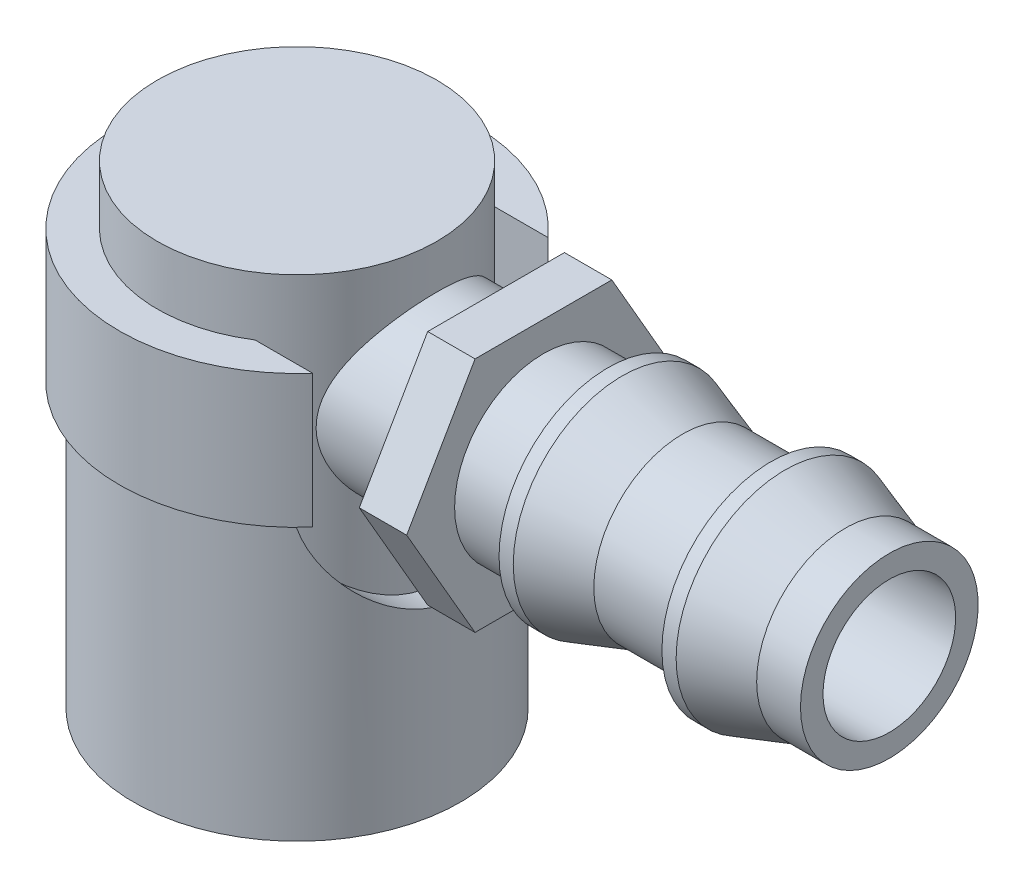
ISO-10303-21;
HEADER;
FILE_DESCRIPTION(('STEP AP214'),'2;1');
FILE_NAME('part.step','',(''),(''),'','','');
FILE_SCHEMA(('AUTOMOTIVE_DESIGN { 1 0 10303 214 1 1 1 1 }'));
ENDSEC;
DATA;
#1=APPLICATION_CONTEXT('core data for automotive mechanical design processes');
#2=APPLICATION_PROTOCOL_DEFINITION('international standard','automotive_design',2000,#1);
#3=PRODUCT_CONTEXT('',#1,'mechanical');
#4=PRODUCT('Part','Part','',(#3));
#5=PRODUCT_RELATED_PRODUCT_CATEGORY('part','',(#4));
#6=PRODUCT_DEFINITION_FORMATION('','',#4);
#7=PRODUCT_DEFINITION_CONTEXT('part definition',#1,'design');
#8=PRODUCT_DEFINITION('design','',#6,#7);
#9=PRODUCT_DEFINITION_SHAPE('','',#8);
#10=(LENGTH_UNIT() NAMED_UNIT(*) SI_UNIT(.MILLI.,.METRE.));
#11=(NAMED_UNIT(*) PLANE_ANGLE_UNIT() SI_UNIT($,.RADIAN.));
#12=(NAMED_UNIT(*) SI_UNIT($,.STERADIAN.) SOLID_ANGLE_UNIT());
#13=UNCERTAINTY_MEASURE_WITH_UNIT(LENGTH_MEASURE(1.E-05),#10,'distance_accuracy_value','');
#14=(GEOMETRIC_REPRESENTATION_CONTEXT(3) GLOBAL_UNCERTAINTY_ASSIGNED_CONTEXT((#13)) GLOBAL_UNIT_ASSIGNED_CONTEXT((#10,
#11,#12)) REPRESENTATION_CONTEXT('',''));
#15=CARTESIAN_POINT('',(0.,0.,0.));
#16=DIRECTION('',(0.,0.,1.));
#17=DIRECTION('',(1.,0.,0.));
#18=AXIS2_PLACEMENT_3D('',#15,#16,#17);
#19=CARTESIAN_POINT('',(0.,3.91209610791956,0.));
#20=DIRECTION('',(0.,1.,0.));
#21=DIRECTION('',(0.,0.,1.));
#22=AXIS2_PLACEMENT_3D('',#19,#20,#21);
#23=CYLINDRICAL_SURFACE('',#22,5.0546);
#24=CARTESIAN_POINT('',(0.,-1.27,0.));
#25=DIRECTION('',(0.,1.,0.));
#26=DIRECTION('',(0.,0.,1.));
#27=AXIS2_PLACEMENT_3D('',#24,#25,#26);
#28=CIRCLE('',#27,5.0546);
#29=CARTESIAN_POINT('',(0.,-1.27,5.0546));
#30=VERTEX_POINT('',#29);
#31=EDGE_CURVE('E11',#30,#30,#28,.T.);
#32=ORIENTED_EDGE('',*,*,#31,.T.);
#33=EDGE_LOOP('',(#32));
#34=FACE_BOUND('',#33,.T.);
#35=CARTESIAN_POINT('',(0.,3.175,0.));
#36=DIRECTION('',(0.,1.,0.));
#37=DIRECTION('',(0.,0.,1.));
#38=AXIS2_PLACEMENT_3D('',#35,#36,#37);
#39=CIRCLE('',#38,5.0546);
#40=CARTESIAN_POINT('',(0.,3.175,5.0546));
#41=VERTEX_POINT('',#40);
#42=EDGE_CURVE('E54',#41,#41,#39,.T.);
#43=ORIENTED_EDGE('',*,*,#42,.F.);
#44=EDGE_LOOP('',(#43));
#45=FACE_BOUND('',#44,.T.);
#46=ADVANCED_FACE('F40',(#34,#45),#23,.T.);
#47=CARTESIAN_POINT('',(-5.0546,-1.27,0.));
#48=DIRECTION('',(0.,-1.,0.));
#49=DIRECTION('',(0.,0.,-1.));
#50=AXIS2_PLACEMENT_3D('',#47,#48,#49);
#51=PLANE('',#50);
#52=CARTESIAN_POINT('',(0.,-1.27,0.));
#53=DIRECTION('',(0.,1.,0.));
#54=DIRECTION('',(0.,0.,1.));
#55=AXIS2_PLACEMENT_3D('',#52,#53,#54);
#56=CIRCLE('',#55,3.5687);
#57=CARTESIAN_POINT('',(0.,-1.27,3.5687));
#58=VERTEX_POINT('',#57);
#59=EDGE_CURVE('E46',#58,#58,#56,.T.);
#60=ORIENTED_EDGE('',*,*,#59,.T.);
#61=EDGE_LOOP('',(#60));
#62=FACE_BOUND('',#61,.T.);
#63=ORIENTED_EDGE('',*,*,#31,.F.);
#64=EDGE_LOOP('',(#63));
#65=FACE_BOUND('',#64,.T.);
#66=ADVANCED_FACE('F64',(#62,#65),#51,.T.);
#67=CARTESIAN_POINT('',(0.,3.91209610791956,0.));
#68=DIRECTION('',(0.,1.,0.));
#69=DIRECTION('',(0.,0.,1.));
#70=AXIS2_PLACEMENT_3D('',#67,#68,#69);
#71=CYLINDRICAL_SURFACE('',#70,3.5687);
#72=CARTESIAN_POINT('',(0.,3.175,0.));
#73=DIRECTION('',(0.,1.,0.));
#74=DIRECTION('',(0.,0.,1.));
#75=AXIS2_PLACEMENT_3D('',#72,#73,#74);
#76=CIRCLE('',#75,3.5687);
#77=CARTESIAN_POINT('',(0.,3.175,3.5687));
#78=VERTEX_POINT('',#77);
#79=EDGE_CURVE('E50',#78,#78,#76,.T.);
#80=ORIENTED_EDGE('',*,*,#79,.T.);
#81=EDGE_LOOP('',(#80));
#82=FACE_BOUND('',#81,.T.);
#83=ORIENTED_EDGE('',*,*,#59,.F.);
#84=EDGE_LOOP('',(#83));
#85=FACE_BOUND('',#84,.T.);
#86=ADVANCED_FACE('F68',(#82,#85),#71,.F.);
#87=CARTESIAN_POINT('',(-5.0546,3.175,0.));
#88=DIRECTION('',(0.,1.,0.));
#89=DIRECTION('',(0.,0.,1.));
#90=AXIS2_PLACEMENT_3D('',#87,#88,#89);
#91=PLANE('',#90);
#92=ORIENTED_EDGE('',*,*,#42,.T.);
#93=EDGE_LOOP('',(#92));
#94=FACE_BOUND('',#93,.T.);
#95=ORIENTED_EDGE('',*,*,#79,.F.);
#96=EDGE_LOOP('',(#95));
#97=FACE_BOUND('',#96,.T.);
#98=ADVANCED_FACE('F60',(#94,#97),#91,.T.);
#99=CLOSED_SHELL('',(#46,#66,#86,#98));
#100=MANIFOLD_SOLID_BREP('B2',#99);
#101=CARTESIAN_POINT('',(-48.3154717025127,8.763,0.));
#102=DIRECTION('',(-1.,0.,0.));
#103=DIRECTION('',(0.,0.,1.));
#104=AXIS2_PLACEMENT_3D('',#101,#102,#103);
#105=CYLINDRICAL_SURFACE('',#104,4.7625);
#106=CARTESIAN_POINT('',(5.7847768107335,8.763,4.7625));
#107=CARTESIAN_POINT('',(5.78477803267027,8.88087596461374,4.76249924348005));
#108=CARTESIAN_POINT('',(5.78839522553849,8.99876325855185,4.75811526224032));
#109=CARTESIAN_POINT('',(5.80269577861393,9.2335084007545,4.74066388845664));
#110=CARTESIAN_POINT('',(5.81338283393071,9.35036567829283,4.72759195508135));
#111=CARTESIAN_POINT('',(5.84136268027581,9.58223378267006,4.69297612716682));
#112=CARTESIAN_POINT('',(5.85866764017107,9.69724079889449,4.67141662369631));
#113=CARTESIAN_POINT('',(5.89915028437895,9.9244002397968,4.62018784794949));
#114=CARTESIAN_POINT('',(5.92233092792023,10.0365511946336,4.59051448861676));
#115=CARTESIAN_POINT('',(5.99890836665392,10.3656229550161,4.4905635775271));
#116=CARTESIAN_POINT('',(6.05965450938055,10.5775100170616,4.40899197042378));
#117=CARTESIAN_POINT('',(6.19356510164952,10.9841832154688,4.21880062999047));
#118=CARTESIAN_POINT('',(6.26673059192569,11.1789679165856,4.11017862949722));
#119=CARTESIAN_POINT('',(6.42951943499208,11.5758703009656,3.85134301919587));
#120=CARTESIAN_POINT('',(6.52001536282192,11.7752265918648,3.69744268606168));
#121=CARTESIAN_POINT('',(6.70025326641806,12.147720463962,3.35980134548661));
#122=CARTESIAN_POINT('',(6.78999450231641,12.3208346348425,3.17603399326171));
#123=CARTESIAN_POINT('',(6.92371835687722,12.5682351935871,2.86739164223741));
#124=CARTESIAN_POINT('',(6.97058838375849,12.6526959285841,2.75178517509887));
#125=CARTESIAN_POINT('',(7.06040458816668,12.8114520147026,2.51237973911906));
#126=CARTESIAN_POINT('',(7.10335241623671,12.8857516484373,2.38858425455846));
#127=CARTESIAN_POINT('',(7.1840876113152,13.0233487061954,2.13350082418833));
#128=CARTESIAN_POINT('',(7.22187758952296,13.0866517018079,2.00221671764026));
#129=CARTESIAN_POINT('',(7.29116835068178,13.2014217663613,1.73297986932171));
#130=CARTESIAN_POINT('',(7.32267032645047,13.2528910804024,1.59502839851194));
#131=CARTESIAN_POINT('',(7.37544878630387,13.3384356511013,1.3282766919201));
#132=CARTESIAN_POINT('',(7.39744882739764,13.3737647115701,1.20002124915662));
#133=CARTESIAN_POINT('',(7.43495006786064,13.4336945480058,0.940104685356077));
#134=CARTESIAN_POINT('',(7.45045239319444,13.4582971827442,0.808444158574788));
#135=CARTESIAN_POINT('',(7.47448589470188,13.4963406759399,0.543004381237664));
#136=CARTESIAN_POINT('',(7.48302308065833,13.5097911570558,0.409227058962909));
#137=CARTESIAN_POINT('',(7.49288142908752,13.5253173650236,0.140754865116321));
#138=CARTESIAN_POINT('',(7.49420346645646,13.5273944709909,0.0060601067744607));
#139=CARTESIAN_POINT('',(7.48991620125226,13.5206469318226,-0.244177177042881));
#140=CARTESIAN_POINT('',(7.48524489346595,13.5132976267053,-0.359779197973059));
#141=CARTESIAN_POINT('',(7.47063709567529,13.4902460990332,-0.589847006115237));
#142=CARTESIAN_POINT('',(7.46069903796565,13.474541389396,-0.704312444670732));
#143=CARTESIAN_POINT('',(7.43578371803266,13.4349881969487,-0.931229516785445));
#144=CARTESIAN_POINT('',(7.42080816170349,13.4111424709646,-1.04368181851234));
#145=CARTESIAN_POINT('',(7.38614959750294,13.3556057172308,-1.26590644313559));
#146=CARTESIAN_POINT('',(7.36646476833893,13.323911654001,-1.37567771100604));
#147=CARTESIAN_POINT('',(7.30090692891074,13.2175224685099,-1.70010406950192));
#148=CARTESIAN_POINT('',(7.24853075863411,13.1315206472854,-1.9098700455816));
#149=CARTESIAN_POINT('',(7.13048181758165,12.932712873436,-2.31200079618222));
#150=CARTESIAN_POINT('',(7.06480618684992,12.8199011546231,-2.50436181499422));
#151=CARTESIAN_POINT('',(6.91572241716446,12.5547157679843,-2.89245360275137));
#152=CARTESIAN_POINT('',(6.83112220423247,12.3991440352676,-3.08553768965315));
#153=CARTESIAN_POINT('',(6.65729419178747,12.0610326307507,-3.44460926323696));
#154=CARTESIAN_POINT('',(6.56805964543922,11.8784528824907,-3.61055569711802));
#155=CARTESIAN_POINT('',(6.43045413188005,11.5731260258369,-3.84762514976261));
#156=CARTESIAN_POINT('',(6.38105055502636,11.4585161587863,-3.92878627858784));
#157=CARTESIAN_POINT('',(6.28473046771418,11.2218449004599,-4.08109431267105));
#158=CARTESIAN_POINT('',(6.2378144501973,11.0997820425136,-4.15223923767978));
#159=CARTESIAN_POINT('',(6.10342477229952,10.7233225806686,-4.34954088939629));
#160=CARTESIAN_POINT('',(6.02200725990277,10.4580216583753,-4.46005980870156));
#161=CARTESIAN_POINT('',(5.90804069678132,9.97946058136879,-4.60939104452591));
#162=CARTESIAN_POINT('',(5.86823692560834,9.77140889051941,-4.65949652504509));
#163=CARTESIAN_POINT('',(5.81047071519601,9.34758885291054,-4.73134921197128));
#164=CARTESIAN_POINT('',(5.79247643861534,9.13183222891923,-4.75313775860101));
#165=CARTESIAN_POINT('',(5.78106869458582,8.69810222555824,-4.7670118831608));
#166=CARTESIAN_POINT('',(5.78772270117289,8.48012439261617,-4.75901592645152));
#167=CARTESIAN_POINT('',(5.82467975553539,8.04922118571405,-4.71369778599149));
#168=CARTESIAN_POINT('',(5.8550025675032,7.83630018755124,-4.67635109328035));
#169=CARTESIAN_POINT('',(5.93392987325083,7.42599194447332,-4.57574456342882));
#170=CARTESIAN_POINT('',(5.98208046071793,7.22835515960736,-4.51312489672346));
#171=CARTESIAN_POINT('',(6.09137941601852,6.84599850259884,-4.36447402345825));
#172=CARTESIAN_POINT('',(6.15253232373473,6.6612831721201,-4.27843463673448));
#173=CARTESIAN_POINT('',(6.29522761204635,6.27198318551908,-4.06626246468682));
#174=CARTESIAN_POINT('',(6.37842459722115,6.07048652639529,-3.93559094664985));
#175=CARTESIAN_POINT('',(6.54815112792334,5.68994420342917,-3.64621860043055));
#176=CARTESIAN_POINT('',(6.63468412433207,5.51092264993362,-3.48748810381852));
#177=CARTESIAN_POINT('',(6.76915911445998,5.24662120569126,-3.21500027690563));
#178=CARTESIAN_POINT('',(6.81830309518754,5.15312246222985,-3.10968128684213));
#179=CARTESIAN_POINT('',(6.91407234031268,4.97533983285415,-2.89049045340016));
#180=CARTESIAN_POINT('',(6.96069851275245,4.89105261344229,-2.77662172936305));
#181=CARTESIAN_POINT('',(7.05021413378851,4.73234641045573,-2.54075758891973));
#182=CARTESIAN_POINT('',(7.09310245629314,4.65793039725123,-2.41875974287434));
#183=CARTESIAN_POINT('',(7.1739136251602,4.51982566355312,-2.16735496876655));
#184=CARTESIAN_POINT('',(7.21183955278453,4.45613027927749,-2.03795271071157));
#185=CARTESIAN_POINT('',(7.27981724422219,4.3432694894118,-1.7793932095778));
#186=CARTESIAN_POINT('',(7.31017533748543,4.29352191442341,-1.65057120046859));
#187=CARTESIAN_POINT('',(7.36455200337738,4.20512789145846,-1.38794381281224));
#188=CARTESIAN_POINT('',(7.38857424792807,4.1664750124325,-1.25414137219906));
#189=CARTESIAN_POINT('',(7.42953868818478,4.10091278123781,-0.982759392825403));
#190=CARTESIAN_POINT('',(7.44648769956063,4.07399212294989,-0.845183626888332));
#191=CARTESIAN_POINT('',(7.47278019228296,4.03234846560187,-0.567488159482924));
#192=CARTESIAN_POINT('',(7.48212505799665,4.01762324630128,-0.427368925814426));
#193=CARTESIAN_POINT('',(7.49207169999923,4.00195786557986,-0.167684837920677));
#194=CARTESIAN_POINT('',(7.49379508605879,3.99924908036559,-0.0482653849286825));
#195=CARTESIAN_POINT('',(7.49153102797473,4.00281120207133,0.190382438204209));
#196=CARTESIAN_POINT('',(7.4875439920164,4.00908146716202,0.309610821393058));
#197=CARTESIAN_POINT('',(7.47395788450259,4.03050891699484,0.546927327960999));
#198=CARTESIAN_POINT('',(7.46435934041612,4.04566526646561,0.66501555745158));
#199=CARTESIAN_POINT('',(7.43978397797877,4.0846486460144,0.899180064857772));
#200=CARTESIAN_POINT('',(7.42480707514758,4.10847581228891,1.01525631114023));
#201=CARTESIAN_POINT('',(7.39059084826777,4.16325784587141,1.23956217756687));
#202=CARTESIAN_POINT('',(7.37156733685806,4.19385417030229,1.3479126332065));
#203=CARTESIAN_POINT('',(7.32930990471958,4.26234866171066,1.56145230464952));
#204=CARTESIAN_POINT('',(7.30607455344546,4.30024930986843,1.66664043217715));
#205=CARTESIAN_POINT('',(7.23071715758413,4.42433831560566,1.97658115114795));
#206=CARTESIAN_POINT('',(7.17291587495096,4.52095737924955,2.17588597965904));
#207=CARTESIAN_POINT('',(7.03986747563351,4.74981872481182,2.57568315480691));
#208=CARTESIAN_POINT('',(6.96344965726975,4.8846686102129,2.77427377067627));
#209=CARTESIAN_POINT('',(6.80296226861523,5.18080015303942,3.14738974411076));
#210=CARTESIAN_POINT('',(6.71888440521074,5.34211061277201,3.32188849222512));
#211=CARTESIAN_POINT('',(6.53657211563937,5.71449247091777,3.66909192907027));
#212=CARTESIAN_POINT('',(6.43810984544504,5.92939898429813,3.83758229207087));
#213=CARTESIAN_POINT('',(6.25001272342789,6.38758159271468,4.13686074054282));
#214=CARTESIAN_POINT('',(6.16037432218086,6.63084619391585,4.26766402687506));
#215=CARTESIAN_POINT('',(6.01960709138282,7.08723242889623,4.46326060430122));
#216=CARTESIAN_POINT('',(5.96434233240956,7.29552685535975,4.53620781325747));
#217=CARTESIAN_POINT('',(5.89633263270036,7.61667449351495,4.62381386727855));
#218=CARTESIAN_POINT('',(5.87615617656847,7.72506689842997,4.64936604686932));
#219=CARTESIAN_POINT('',(5.84143446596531,7.9442264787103,4.69291769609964));
#220=CARTESIAN_POINT('',(5.82688660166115,8.05499252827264,4.71092066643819));
#221=CARTESIAN_POINT('',(5.8053363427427,8.26510284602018,4.73744376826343));
#222=CARTESIAN_POINT('',(5.79765085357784,8.36426921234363,4.74682621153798));
#223=CARTESIAN_POINT('',(5.78736987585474,8.56328755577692,4.75935549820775));
#224=CARTESIAN_POINT('',(5.78477577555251,8.66313971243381,4.76250064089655));
#225=CARTESIAN_POINT('',(5.7847768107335,8.763,4.7625));
#226=B_SPLINE_CURVE_WITH_KNOTS('',3,(#106,#107,#108,#109,#110,#111,#112,#113,#114,#115,#116,
#117,#118,#119,#120,#121,#122,#123,#124,#125,#126,#127,#128,#129,#130,#131,#132,#133,#134,#135,
#136,#137,#138,#139,#140,#141,#142,#143,#144,#145,#146,#147,#148,#149,#150,#151,#152,#153,#154,
#155,#156,#157,#158,#159,#160,#161,#162,#163,#164,#165,#166,#167,#168,#169,#170,#171,#172,#173,
#174,#175,#176,#177,#178,#179,#180,#181,#182,#183,#184,#185,#186,#187,#188,#189,#190,#191,#192,
#193,#194,#195,#196,#197,#198,#199,#200,#201,#202,#203,#204,#205,#206,#207,#208,#209,#210,#211,
#212,#213,#214,#215,#216,#217,#218,#219,#220,#221,#222,#223,#224,#225),.UNSPECIFIED.,.T.,.F.,(4,
2,2,2,2,2,2,2,2,2,2,2,2,2,2,2,2,2,2,2,2,2,2,2,2,2,2,2,2,2,2,2,2,2,2,2,2,2,2,2,2,2,2,2,2,2,2,2,2,
2,2,2,2,2,2,2,2,2,2,4),(0.,0.353512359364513,0.707209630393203,1.06156042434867,
1.41609003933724,2.11805380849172,2.82007643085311,3.61993834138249,4.42050965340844,
4.87193585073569,5.32317119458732,5.77417724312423,6.22509765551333,6.62902009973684,
7.0328725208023,7.43637611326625,7.8398307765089,8.18720022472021,8.53467312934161,
8.88202848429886,9.22951839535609,9.92450327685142,10.6196377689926,11.4026261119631,
12.1867881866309,12.6329047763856,13.0791094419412,13.9689746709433,14.6193681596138,
15.2688110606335,15.920033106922,16.5717995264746,17.2080001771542,17.844423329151,
18.6041982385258,19.3647813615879,19.8117939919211,20.2586443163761,20.7056288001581,
21.1523344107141,21.5758766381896,21.9991728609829,22.4220602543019,22.844870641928,
23.2027989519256,23.5607016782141,23.9185707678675,24.2764454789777,24.6186204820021,
24.9609119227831,25.6449506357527,26.3978767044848,27.1516278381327,28.0187057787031,
28.885433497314,29.5650829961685,29.9042596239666,30.2432787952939,30.542680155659,
30.8421631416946),.UNSPECIFIED.);
#227=CARTESIAN_POINT('',(5.7847768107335,8.763,4.7625));
#228=VERTEX_POINT('',#227);
#229=EDGE_CURVE('E105',#228,#228,#226,.T.);
#230=ORIENTED_EDGE('',*,*,#229,.F.);
#231=EDGE_LOOP('',(#230));
#232=FACE_BOUND('',#231,.T.);
#233=CARTESIAN_POINT('',(10.668,8.763,0.));
#234=DIRECTION('',(1.,0.,0.));
#235=DIRECTION('',(0.,0.,-1.));
#236=AXIS2_PLACEMENT_3D('',#233,#234,#235);
#237=CIRCLE('',#236,4.7625);
#238=CARTESIAN_POINT('',(10.668,8.763,-4.7625));
#239=VERTEX_POINT('',#238);
#240=EDGE_CURVE('E38',#239,#239,#237,.T.);
#241=ORIENTED_EDGE('',*,*,#240,.F.);
#242=EDGE_LOOP('',(#241));
#243=FACE_BOUND('',#242,.T.);
#244=ADVANCED_FACE('F101',(#232,#243),#105,.T.);
#245=CARTESIAN_POINT('',(0.,0.,0.));
#246=DIRECTION('',(0.,-1.,0.));
#247=DIRECTION('',(0.,0.,-1.));
#248=AXIS2_PLACEMENT_3D('',#245,#246,#247);
#249=CYLINDRICAL_SURFACE('',#248,7.493);
#250=CARTESIAN_POINT('',(4.0500855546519,5.588,-6.30411421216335));
#251=CARTESIAN_POINT('',(4.08142761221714,5.42125876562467,-6.28396663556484));
#252=CARTESIAN_POINT('',(4.12220661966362,5.25753568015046,-6.25746123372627));
#253=CARTESIAN_POINT('',(4.2183557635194,4.93751208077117,-6.19304940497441));
#254=CARTESIAN_POINT('',(4.27365947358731,4.78118150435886,-6.15519477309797));
#255=CARTESIAN_POINT('',(4.3944055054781,4.47713941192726,-6.06956887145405));
#256=CARTESIAN_POINT('',(4.45975594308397,4.32936501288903,-6.02188625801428));
#257=CARTESIAN_POINT('',(4.5978361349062,4.04053357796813,-5.91713471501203));
#258=CARTESIAN_POINT('',(4.67057606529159,3.89948620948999,-5.8600527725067));
#259=CARTESIAN_POINT('',(4.84595260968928,3.57790482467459,-5.71651472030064));
#260=CARTESIAN_POINT('',(4.95045643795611,3.39992778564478,-5.62661720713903));
#261=CARTESIAN_POINT('',(5.16344887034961,3.05500339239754,-5.43182370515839));
#262=CARTESIAN_POINT('',(5.27193726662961,2.88805546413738,-5.32692849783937));
#263=CARTESIAN_POINT('',(5.49007735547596,2.56413363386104,-5.10184122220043));
#264=CARTESIAN_POINT('',(5.59973210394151,2.40720916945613,-4.98158097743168));
#265=CARTESIAN_POINT('',(5.81690869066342,2.10441547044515,-4.72617411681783));
#266=CARTESIAN_POINT('',(5.92443095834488,1.95854399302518,-4.59103053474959));
#267=CARTESIAN_POINT('',(6.11743621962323,1.70173196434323,-4.32942279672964));
#268=CARTESIAN_POINT('',(6.20362095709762,1.58900648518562,-4.20522565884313));
#269=CARTESIAN_POINT('',(6.37137040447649,1.37239958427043,-3.94644829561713));
#270=CARTESIAN_POINT('',(6.45293609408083,1.26851628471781,-3.81187028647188));
#271=CARTESIAN_POINT('',(6.60983235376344,1.07070558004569,-3.53280646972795));
#272=CARTESIAN_POINT('',(6.68517913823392,0.976752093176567,-3.38834834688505));
#273=CARTESIAN_POINT('',(6.82842642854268,0.79954251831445,-3.0895109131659));
#274=CARTESIAN_POINT('',(6.89632858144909,0.716284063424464,-2.93513380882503));
#275=CARTESIAN_POINT('',(7.01053181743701,0.577110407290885,-2.6488250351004));
#276=CARTESIAN_POINT('',(7.05843828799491,0.51905554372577,-2.51857044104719));
#277=CARTESIAN_POINT('',(7.14778005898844,0.411218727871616,-2.25254643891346));
#278=CARTESIAN_POINT('',(7.18921680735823,0.361434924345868,-2.11677827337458));
#279=CARTESIAN_POINT('',(7.2648969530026,0.270789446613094,-1.84034080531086));
#280=CARTESIAN_POINT('',(7.29914076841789,0.229927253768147,-1.69967178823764));
#281=CARTESIAN_POINT('',(7.35977377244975,0.157738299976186,-1.41423580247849));
#282=CARTESIAN_POINT('',(7.38616286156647,0.126411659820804,-1.26946878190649));
#283=CARTESIAN_POINT('',(7.43065179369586,0.0736763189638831,-0.976015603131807));
#284=CARTESIAN_POINT('',(7.44870426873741,0.0523242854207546,-0.827312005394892));
#285=CARTESIAN_POINT('',(7.47588811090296,0.0201952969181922,-0.527951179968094));
#286=CARTESIAN_POINT('',(7.48501946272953,0.00941836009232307,-0.377293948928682));
#287=CARTESIAN_POINT('',(7.49414283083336,-0.00134914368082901,-0.0753571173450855));
#288=CARTESIAN_POINT('',(7.49413727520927,-0.0013425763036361,0.0759223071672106));
#289=CARTESIAN_POINT('',(7.48499227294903,0.00945043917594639,0.37781107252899));
#290=CARTESIAN_POINT('',(7.47585338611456,0.0202362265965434,0.52842045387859));
#291=CARTESIAN_POINT('',(7.44990377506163,0.0509066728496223,0.814023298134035));
#292=CARTESIAN_POINT('',(7.4338688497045,0.0698716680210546,0.949188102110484));
#293=CARTESIAN_POINT('',(7.39473664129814,0.116242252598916,1.21706562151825));
#294=CARTESIAN_POINT('',(7.37163701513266,0.143650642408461,1.34977750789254));
#295=CARTESIAN_POINT('',(7.31879236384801,0.206510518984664,1.6118910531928));
#296=CARTESIAN_POINT('',(7.28904901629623,0.241959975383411,1.74129353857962));
#297=CARTESIAN_POINT('',(7.22340662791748,0.320446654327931,1.99619588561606));
#298=CARTESIAN_POINT('',(7.18750527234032,0.363486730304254,2.12169425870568));
#299=CARTESIAN_POINT('',(7.06690322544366,0.508629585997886,2.50568327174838));
#300=CARTESIAN_POINT('',(6.97239759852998,0.623110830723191,2.75656511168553));
#301=CARTESIAN_POINT('',(6.76371828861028,0.87909100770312,3.23503872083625));
#302=CARTESIAN_POINT('',(6.64953695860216,1.02060044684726,3.46262137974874));
#303=CARTESIAN_POINT('',(6.43803285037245,1.28734163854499,3.83804363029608));
#304=CARTESIAN_POINT('',(6.34388084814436,1.40746168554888,3.99137942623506));
#305=CARTESIAN_POINT('',(6.14980062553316,1.65916503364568,4.28437547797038));
#306=CARTESIAN_POINT('',(6.04987212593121,1.79074888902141,4.42403507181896));
#307=CARTESIAN_POINT('',(5.84599428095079,2.06496245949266,4.69016038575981));
#308=CARTESIAN_POINT('',(5.74203124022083,2.20763181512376,4.81657456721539));
#309=CARTESIAN_POINT('',(5.53270307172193,2.50303543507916,5.05563704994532));
#310=CARTESIAN_POINT('',(5.42733830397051,2.65576715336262,5.16828881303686));
#311=CARTESIAN_POINT('',(5.23271535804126,2.94868251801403,5.36470233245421));
#312=CARTESIAN_POINT('',(5.14330577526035,3.08754347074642,5.45029239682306));
#313=CARTESIAN_POINT('',(4.96723872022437,3.37283202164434,5.61122133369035));
#314=CARTESIAN_POINT('',(4.88058186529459,3.51926129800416,5.68655791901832));
#315=CARTESIAN_POINT('',(4.71308616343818,3.81899729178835,5.82611902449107));
#316=CARTESIAN_POINT('',(4.63221106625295,3.97224913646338,5.89041713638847));
#317=CARTESIAN_POINT('',(4.47884149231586,4.28690830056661,6.00785657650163));
#318=CARTESIAN_POINT('',(4.40634032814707,4.44830896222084,6.06100683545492));
#319=CARTESIAN_POINT('',(4.27819617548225,4.76871959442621,6.15206191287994));
#320=CARTESIAN_POINT('',(4.22175348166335,4.92717675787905,6.1907446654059));
#321=CARTESIAN_POINT('',(4.12358540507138,5.25201251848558,6.25656488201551));
#322=CARTESIAN_POINT('',(4.08195954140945,5.41843646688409,6.28362451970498));
#323=CARTESIAN_POINT('',(4.0500855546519,5.588,6.30411421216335));
#324=B_SPLINE_CURVE_WITH_KNOTS('',3,(#250,#251,#252,#253,#254,#255,#256,#257,#258,#259,#260,
#261,#262,#263,#264,#265,#266,#267,#268,#269,#270,#271,#272,#273,#274,#275,#276,#277,#278,#279,
#280,#281,#282,#283,#284,#285,#286,#287,#288,#289,#290,#291,#292,#293,#294,#295,#296,#297,#298,
#299,#300,#301,#302,#303,#304,#305,#306,#307,#308,#309,#310,#311,#312,#313,#314,#315,#316,#317,
#318,#319,#320,#321,#322,#323),.UNSPECIFIED.,.F.,.F.,(4,2,2,2,2,2,2,2,2,2,2,2,2,2,2,2,2,2,2,2,2,
2,2,2,2,2,2,2,2,2,2,2,2,2,2,2,4),(0.,0.511491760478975,1.02068384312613,1.52546924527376,
2.03095946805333,2.70538346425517,3.37977233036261,4.05726481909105,4.7346194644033,
5.2998372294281,5.86493465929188,6.42850884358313,6.99195808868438,7.44284549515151,
7.89363184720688,8.34439198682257,8.79515783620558,9.24845430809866,9.70175155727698,
10.1549283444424,10.6080773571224,11.0198935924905,11.4318465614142,11.8436956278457,
12.2556998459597,13.1267307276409,13.9981009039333,14.6463253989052,15.2945812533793,
15.9452725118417,16.5957997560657,17.1534300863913,17.7111846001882,18.2650626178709,
18.8184952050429,19.3351816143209,19.8552756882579),.UNSPECIFIED.);
#325=CARTESIAN_POINT('',(4.0500855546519,5.588,-6.30411421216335));
#326=VERTEX_POINT('',#325);
#327=CARTESIAN_POINT('',(4.0500855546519,5.588,6.30411421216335));
#328=VERTEX_POINT('',#327);
#329=EDGE_CURVE('E691',#326,#328,#324,.T.);
#330=ORIENTED_EDGE('',*,*,#329,.F.);
#331=DIRECTION('',(0.,-1.,0.));
#332=VECTOR('',#331,1.);
#333=CARTESIAN_POINT('',(4.0500855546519,12.73175,-6.30411421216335));
#334=LINE('',#333,#332);
#335=CARTESIAN_POINT('',(4.0500855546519,12.73175,-6.30411421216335));
#336=VERTEX_POINT('',#335);
#337=EDGE_CURVE('E751',#336,#326,#334,.T.);
#338=ORIENTED_EDGE('',*,*,#337,.F.);
#339=CARTESIAN_POINT('',(0.,12.73175,0.));
#340=DIRECTION('',(0.,-1.,0.));
#341=DIRECTION('',(0.,0.,1.));
#342=AXIS2_PLACEMENT_3D('',#339,#340,#341);
#343=CIRCLE('',#342,7.493);
#344=CARTESIAN_POINT('',(4.0500855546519,12.73175,6.30411421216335));
#345=VERTEX_POINT('',#344);
#346=EDGE_CURVE('E758',#345,#336,#343,.T.);
#347=ORIENTED_EDGE('',*,*,#346,.F.);
#348=DIRECTION('',(0.,-1.,0.));
#349=VECTOR('',#348,1.);
#350=CARTESIAN_POINT('',(4.0500855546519,12.73175,6.30411421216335));
#351=LINE('',#350,#349);
#352=EDGE_CURVE('E372',#345,#328,#351,.T.);
#353=ORIENTED_EDGE('',*,*,#352,.T.);
#354=EDGE_LOOP('',(#330,#338,#347,#353));
#355=FACE_BOUND('',#354,.T.);
#356=CARTESIAN_POINT('',(0.,15.875,0.));
#357=DIRECTION('',(0.,-1.,0.));
#358=DIRECTION('',(0.,0.,-1.));
#359=AXIS2_PLACEMENT_3D('',#356,#357,#358);
#360=CIRCLE('',#359,7.493);
#361=CARTESIAN_POINT('',(0.,15.875,-7.493));
#362=VERTEX_POINT('',#361);
#363=EDGE_CURVE('E115',#362,#362,#360,.T.);
#364=ORIENTED_EDGE('',*,*,#363,.T.);
#365=EDGE_LOOP('',(#364));
#366=FACE_BOUND('',#365,.T.);
#367=ORIENTED_EDGE('',*,*,#229,.T.);
#368=EDGE_LOOP('',(#367));
#369=FACE_BOUND('',#368,.T.);
#370=ADVANCED_FACE('F276',(#355,#366,#369),#249,.T.);
#371=CARTESIAN_POINT('',(0.,15.875,0.));
#372=DIRECTION('',(0.,1.,0.));
#373=DIRECTION('',(0.,0.,1.));
#374=AXIS2_PLACEMENT_3D('',#371,#372,#373);
#375=PLANE('',#374);
#376=ORIENTED_EDGE('',*,*,#363,.F.);
#377=EDGE_LOOP('',(#376));
#378=FACE_BOUND('',#377,.T.);
#379=ADVANCED_FACE('F103',(#378),#375,.T.);
#380=CARTESIAN_POINT('',(7.493,-9.525,0.));
#381=DIRECTION('',(0.,-1.,0.));
#382=DIRECTION('',(0.,0.,-1.));
#383=AXIS2_PLACEMENT_3D('',#380,#381,#382);
#384=PLANE('',#383);
#385=CARTESIAN_POINT('',(0.,-9.525,0.));
#386=DIRECTION('',(0.,-1.,0.));
#387=DIRECTION('',(0.,0.,-1.));
#388=AXIS2_PLACEMENT_3D('',#385,#386,#387);
#389=CIRCLE('',#388,4.7625);
#390=CARTESIAN_POINT('',(0.,-9.525,-4.7625));
#391=VERTEX_POINT('',#390);
#392=EDGE_CURVE('E271',#391,#391,#389,.T.);
#393=ORIENTED_EDGE('',*,*,#392,.F.);
#394=EDGE_LOOP('',(#393));
#395=FACE_BOUND('',#394,.T.);
#396=CARTESIAN_POINT('',(0.,-9.525,0.));
#397=DIRECTION('',(0.,-1.,0.));
#398=DIRECTION('',(0.,0.,-1.));
#399=AXIS2_PLACEMENT_3D('',#396,#397,#398);
#400=CIRCLE('',#399,8.763);
#401=CARTESIAN_POINT('',(0.,-9.525,-8.763));
#402=VERTEX_POINT('',#401);
#403=EDGE_CURVE('E686',#402,#402,#400,.T.);
#404=ORIENTED_EDGE('',*,*,#403,.T.);
#405=EDGE_LOOP('',(#404));
#406=FACE_BOUND('',#405,.T.);
#407=ADVANCED_FACE('F280',(#395,#406),#384,.T.);
#408=CARTESIAN_POINT('',(0.,0.,0.));
#409=DIRECTION('',(0.,-1.,0.));
#410=DIRECTION('',(0.,0.,-1.));
#411=AXIS2_PLACEMENT_3D('',#408,#409,#410);
#412=CYLINDRICAL_SURFACE('',#411,4.7625);
#413=ORIENTED_EDGE('',*,*,#392,.T.);
#414=EDGE_LOOP('',(#413));
#415=FACE_BOUND('',#414,.T.);
#416=CARTESIAN_POINT('',(0.,-1.397,0.));
#417=DIRECTION('',(0.,-1.,0.));
#418=DIRECTION('',(0.,0.,-1.));
#419=AXIS2_PLACEMENT_3D('',#416,#417,#418);
#420=CIRCLE('',#419,4.7625);
#421=CARTESIAN_POINT('',(0.,-1.397,-4.7625));
#422=VERTEX_POINT('',#421);
#423=EDGE_CURVE('E268',#422,#422,#420,.T.);
#424=ORIENTED_EDGE('',*,*,#423,.F.);
#425=EDGE_LOOP('',(#424));
#426=FACE_BOUND('',#425,.T.);
#427=ADVANCED_FACE('F285',(#415,#426),#412,.F.);
#428=CARTESIAN_POINT('',(0.,-1.22835598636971,0.));
#429=DIRECTION('',(0.,1.,0.));
#430=DIRECTION('',(0.,0.,1.));
#431=AXIS2_PLACEMENT_3D('',#428,#429,#430);
#432=CONICAL_SURFACE('',#431,5.0546,1.0471975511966);
#433=ORIENTED_EDGE('',*,*,#423,.T.);
#434=EDGE_LOOP('',(#433));
#435=FACE_BOUND('',#434,.T.);
#436=CARTESIAN_POINT('',(0.,-1.22835598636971,0.));
#437=DIRECTION('',(0.,-1.,0.));
#438=DIRECTION('',(0.,0.,-1.));
#439=AXIS2_PLACEMENT_3D('',#436,#437,#438);
#440=CIRCLE('',#439,5.0546);
#441=CARTESIAN_POINT('',(0.,-1.22835598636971,-5.0546));
#442=VERTEX_POINT('',#441);
#443=EDGE_CURVE('E265',#442,#442,#440,.T.);
#444=ORIENTED_EDGE('',*,*,#443,.F.);
#445=EDGE_LOOP('',(#444));
#446=FACE_BOUND('',#445,.T.);
#447=ADVANCED_FACE('F633',(#435,#446),#432,.F.);
#448=CARTESIAN_POINT('',(0.,0.,0.));
#449=DIRECTION('',(0.,-1.,0.));
#450=DIRECTION('',(0.,0.,-1.));
#451=AXIS2_PLACEMENT_3D('',#448,#449,#450);
#452=CYLINDRICAL_SURFACE('',#451,5.0546);
#453=ORIENTED_EDGE('',*,*,#443,.T.);
#454=EDGE_LOOP('',(#453));
#455=FACE_BOUND('',#454,.T.);
#456=CARTESIAN_POINT('',(0.,3.175,0.));
#457=DIRECTION('',(0.,-1.,0.));
#458=DIRECTION('',(0.,0.,-1.));
#459=AXIS2_PLACEMENT_3D('',#456,#457,#458);
#460=CIRCLE('',#459,5.0546);
#461=CARTESIAN_POINT('',(0.,3.175,-5.0546));
#462=VERTEX_POINT('',#461);
#463=EDGE_CURVE('E262',#462,#462,#460,.T.);
#464=ORIENTED_EDGE('',*,*,#463,.F.);
#465=EDGE_LOOP('',(#464));
#466=FACE_BOUND('',#465,.T.);
#467=ADVANCED_FACE('F624',(#455,#466),#452,.F.);
#468=CARTESIAN_POINT('',(3.5687,3.175,0.));
#469=DIRECTION('',(0.,-1.,0.));
#470=DIRECTION('',(0.,0.,-1.));
#471=AXIS2_PLACEMENT_3D('',#468,#469,#470);
#472=PLANE('',#471);
#473=ORIENTED_EDGE('',*,*,#463,.T.);
#474=EDGE_LOOP('',(#473));
#475=FACE_BOUND('',#474,.T.);
#476=CARTESIAN_POINT('',(0.,3.175,0.));
#477=DIRECTION('',(0.,-1.,0.));
#478=DIRECTION('',(0.,0.,-1.));
#479=AXIS2_PLACEMENT_3D('',#476,#477,#478);
#480=CIRCLE('',#479,3.5687);
#481=CARTESIAN_POINT('',(0.,3.175,-3.5687));
#482=VERTEX_POINT('',#481);
#483=EDGE_CURVE('E259',#482,#482,#480,.T.);
#484=ORIENTED_EDGE('',*,*,#483,.F.);
#485=EDGE_LOOP('',(#484));
#486=FACE_BOUND('',#485,.T.);
#487=ADVANCED_FACE('F619',(#475,#486),#472,.T.);
#488=CARTESIAN_POINT('',(0.,0.,0.));
#489=DIRECTION('',(0.,-1.,0.));
#490=DIRECTION('',(0.,0.,-1.));
#491=AXIS2_PLACEMENT_3D('',#488,#489,#490);
#492=CYLINDRICAL_SURFACE('',#491,3.5687);
#493=CARTESIAN_POINT('',(0.300805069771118,8.763,-3.556));
#494=CARTESIAN_POINT('',(0.300812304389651,8.74023268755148,-3.55599960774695));
#495=CARTESIAN_POINT('',(0.303473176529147,8.71741398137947,-3.55577686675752));
#496=CARTESIAN_POINT('',(0.313285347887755,8.67273161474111,-3.554925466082));
#497=CARTESIAN_POINT('',(0.320466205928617,8.65087526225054,-3.55429413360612));
#498=CARTESIAN_POINT('',(0.348420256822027,8.5816552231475,-3.55170040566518));
#499=CARTESIAN_POINT('',(0.374927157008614,8.53680083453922,-3.54906273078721));
#500=CARTESIAN_POINT('',(0.432720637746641,8.4503492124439,-3.54249454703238));
#501=CARTESIAN_POINT('',(0.464048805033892,8.40878560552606,-3.53855240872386));
#502=CARTESIAN_POINT('',(0.533218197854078,8.32184190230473,-3.52883434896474));
#503=CARTESIAN_POINT('',(0.571364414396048,8.2767164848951,-3.52288144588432));
#504=CARTESIAN_POINT('',(0.648829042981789,8.18771049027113,-3.50944439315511));
#505=CARTESIAN_POINT('',(0.688148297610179,8.14383085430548,-3.50195911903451));
#506=CARTESIAN_POINT('',(0.807017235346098,8.01324719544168,-3.47719419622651));
#507=CARTESIAN_POINT('',(0.887385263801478,7.92770701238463,-3.45761797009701));
#508=CARTESIAN_POINT('',(1.04805677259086,7.75872742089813,-3.41235602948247));
#509=CARTESIAN_POINT('',(1.12835972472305,7.67528248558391,-3.38668879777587));
#510=CARTESIAN_POINT('',(1.28835950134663,7.51007720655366,-3.32910951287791));
#511=CARTESIAN_POINT('',(1.36805665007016,7.42831591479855,-3.29720108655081));
#512=CARTESIAN_POINT('',(1.55263487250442,7.23961953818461,-3.21531520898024));
#513=CARTESIAN_POINT('',(1.6570953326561,7.13333580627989,-3.16285559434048));
#514=CARTESIAN_POINT('',(1.86304704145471,6.92431190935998,-3.04609572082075));
#515=CARTESIAN_POINT('',(1.96453675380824,6.8215735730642,-2.98178945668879));
#516=CARTESIAN_POINT('',(2.16330200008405,6.62066369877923,-2.84087539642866));
#517=CARTESIAN_POINT('',(2.26058044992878,6.52248899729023,-2.76427629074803));
#518=CARTESIAN_POINT('',(2.44958011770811,6.33192906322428,-2.59826659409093));
#519=CARTESIAN_POINT('',(2.54130518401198,6.2395398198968,-2.50886502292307));
#520=CARTESIAN_POINT('',(2.73916444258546,6.04037297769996,-2.29323120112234));
#521=CARTESIAN_POINT('',(2.84336576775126,5.93557271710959,-2.16333214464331));
#522=CARTESIAN_POINT('',(3.03655224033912,5.74136744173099,-1.8825352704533));
#523=CARTESIAN_POINT('',(3.12556221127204,5.6519373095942,-1.73167245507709));
#524=CARTESIAN_POINT('',(3.26941024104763,5.50745136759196,-1.43815946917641));
#525=CARTESIAN_POINT('',(3.32750732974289,5.44911388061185,-1.29876852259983));
#526=CARTESIAN_POINT('',(3.40190124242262,5.37442313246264,-1.08101589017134));
#527=CARTESIAN_POINT('',(3.42457897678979,5.35165706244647,-1.00696301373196));
#528=CARTESIAN_POINT('',(3.46530598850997,5.31077388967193,-0.856357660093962));
#529=CARTESIAN_POINT('',(3.48335733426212,5.2926547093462,-0.779806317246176));
#530=CARTESIAN_POINT('',(3.51460730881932,5.2612886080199,-0.624106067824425));
#531=CARTESIAN_POINT('',(3.5277680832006,5.24807969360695,-0.544941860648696));
#532=CARTESIAN_POINT('',(3.54875933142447,5.2270121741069,-0.385240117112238));
#533=CARTESIAN_POINT('',(3.55659231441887,5.2191510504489,-0.304703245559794));
#534=CARTESIAN_POINT('',(3.56675615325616,5.20895076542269,-0.142941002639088));
#535=CARTESIAN_POINT('',(3.56908792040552,5.20661068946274,-0.061715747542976));
#536=CARTESIAN_POINT('',(3.56820590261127,5.20749586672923,0.10064698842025));
#537=CARTESIAN_POINT('',(3.56499262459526,5.21072061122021,0.181784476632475));
#538=CARTESIAN_POINT('',(3.54848673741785,5.22728572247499,0.405322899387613));
#539=CARTESIAN_POINT('',(3.5293498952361,5.24649142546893,0.546934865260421));
#540=CARTESIAN_POINT('',(3.47519285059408,5.30084936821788,0.823780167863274));
#541=CARTESIAN_POINT('',(3.44017024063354,5.33600402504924,0.959012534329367));
#542=CARTESIAN_POINT('',(3.35461573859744,5.42189566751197,1.22579702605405));
#543=CARTESIAN_POINT('',(3.303513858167,5.47320537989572,1.35697908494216));
#544=CARTESIAN_POINT('',(3.18894340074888,5.58827093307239,1.60789486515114));
#545=CARTESIAN_POINT('',(3.125468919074,5.65203271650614,1.72762307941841));
#546=CARTESIAN_POINT('',(2.95149616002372,5.82685359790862,2.01645455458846));
#547=CARTESIAN_POINT('',(2.83413153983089,5.9448429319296,2.17724325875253));
#548=CARTESIAN_POINT('',(2.58278093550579,6.1977560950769,2.4702871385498));
#549=CARTESIAN_POINT('',(2.44874832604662,6.33272744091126,2.60245930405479));
#550=CARTESIAN_POINT('',(2.21260582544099,6.57090066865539,2.80285822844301));
#551=CARTESIAN_POINT('',(2.11338098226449,6.67108121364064,2.87824097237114));
#552=CARTESIAN_POINT('',(1.9108312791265,6.8759302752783,3.01651894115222));
#553=CARTESIAN_POINT('',(1.80750448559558,6.98060091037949,3.0794081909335));
#554=CARTESIAN_POINT('',(1.59806924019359,7.19338512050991,3.19311493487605));
#555=CARTESIAN_POINT('',(1.49196336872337,7.3014955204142,3.243943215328));
#556=CARTESIAN_POINT('',(1.27800341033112,7.52065885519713,3.33403237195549));
#557=CARTESIAN_POINT('',(1.17015016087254,7.63171039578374,3.37329862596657));
#558=CARTESIAN_POINT('',(1.00151738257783,7.80756342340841,3.42587638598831));
#559=CARTESIAN_POINT('',(0.940810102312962,7.87131835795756,3.44302315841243));
#560=CARTESIAN_POINT('',(0.819867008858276,7.99997651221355,3.47380378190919));
#561=CARTESIAN_POINT('',(0.759630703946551,8.06487820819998,3.48744196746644));
#562=CARTESIAN_POINT('',(0.660917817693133,8.1742156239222,3.50719461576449));
#563=CARTESIAN_POINT('',(0.622016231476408,8.21809483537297,3.51428965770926));
#564=CARTESIAN_POINT('',(0.545578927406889,8.30723355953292,3.52696025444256));
#565=CARTESIAN_POINT('',(0.508042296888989,8.35249211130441,3.53253684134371));
#566=CARTESIAN_POINT('',(0.447594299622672,8.43094343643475,3.54060698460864));
#567=CARTESIAN_POINT('',(0.423813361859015,8.46342283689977,3.54351774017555));
#568=CARTESIAN_POINT('',(0.379301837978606,8.53054409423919,3.54855422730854));
#569=CARTESIAN_POINT('',(0.358565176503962,8.56518144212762,3.55068153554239));
#570=CARTESIAN_POINT('',(0.332769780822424,8.61981570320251,3.55316246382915));
#571=CARTESIAN_POINT('',(0.325050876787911,8.63849478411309,3.55387147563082));
#572=CARTESIAN_POINT('',(0.312404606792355,8.67675717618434,3.55500531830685));
#573=CARTESIAN_POINT('',(0.307467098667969,8.69633691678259,3.55543118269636));
#574=CARTESIAN_POINT('',(0.301324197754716,8.736432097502,3.55595771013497));
#575=CARTESIAN_POINT('',(0.300177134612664,8.75695727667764,3.55605329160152));
#576=CARTESIAN_POINT('',(0.302120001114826,8.79780177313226,3.55588856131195));
#577=CARTESIAN_POINT('',(0.305213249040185,8.8181209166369,3.55562797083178));
#578=CARTESIAN_POINT('',(0.316106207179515,8.86322664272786,3.55467731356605));
#579=CARTESIAN_POINT('',(0.324949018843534,8.88774275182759,3.55389048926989));
#580=CARTESIAN_POINT('',(0.346008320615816,8.93532458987,3.55190257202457));
#581=CARTESIAN_POINT('',(0.358244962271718,8.95838061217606,3.55069899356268));
#582=CARTESIAN_POINT('',(0.398055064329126,9.02634770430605,3.54652980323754));
#583=CARTESIAN_POINT('',(0.428510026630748,9.06948230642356,3.54302135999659));
#584=CARTESIAN_POINT('',(0.492230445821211,9.15353130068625,3.53474071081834));
#585=CARTESIAN_POINT('',(0.525504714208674,9.19443802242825,3.52996443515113));
#586=CARTESIAN_POINT('',(0.593557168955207,9.27515339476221,3.51916169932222));
#587=CARTESIAN_POINT('',(0.628341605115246,9.3149560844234,3.51312955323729));
#588=CARTESIAN_POINT('',(0.698525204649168,9.39368536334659,3.49985149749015));
#589=CARTESIAN_POINT('',(0.733923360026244,9.43261318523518,3.49260743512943));
#590=CARTESIAN_POINT('',(0.8299346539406,9.5369373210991,3.47140510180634));
#591=CARTESIAN_POINT('',(0.89087085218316,9.60180729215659,3.45629398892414));
#592=CARTESIAN_POINT('',(1.01293114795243,9.73043944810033,3.42251526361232));
#593=CARTESIAN_POINT('',(1.07405527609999,9.79420143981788,3.40384703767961));
#594=CARTESIAN_POINT('',(1.25725234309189,9.98421453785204,3.34238379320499));
#595=CARTESIAN_POINT('',(1.37902319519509,10.1090582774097,3.29415754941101));
#596=CARTESIAN_POINT('',(1.6193555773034,10.3543454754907,3.1828945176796));
#597=CARTESIAN_POINT('',(1.73792587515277,10.4748013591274,3.11990403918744));
#598=CARTESIAN_POINT('',(1.97063464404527,10.7106366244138,2.97837913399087));
#599=CARTESIAN_POINT('',(2.0847769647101,10.8260204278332,2.89985858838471));
#600=CARTESIAN_POINT('',(2.26489826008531,11.0078535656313,2.75926211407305));
#601=CARTESIAN_POINT('',(2.33277283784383,11.0763125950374,2.70219060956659));
#602=CARTESIAN_POINT('',(2.46562046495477,11.2102171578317,2.58154864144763));
#603=CARTESIAN_POINT('',(2.53059361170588,11.2756627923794,2.51797839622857));
#604=CARTESIAN_POINT('',(2.7202055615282,11.4665631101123,2.31730804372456));
#605=CARTESIAN_POINT('',(2.83977789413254,11.5868242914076,2.17006463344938));
#606=CARTESIAN_POINT('',(3.0374552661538,11.7855370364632,1.87988245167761));
#607=CARTESIAN_POINT('',(3.11909009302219,11.8675590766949,1.74179844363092));
#608=CARTESIAN_POINT('',(3.26554797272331,12.0146716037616,1.44863660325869));
#609=CARTESIAN_POINT('',(3.33039218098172,12.0797833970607,1.29358050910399));
#610=CARTESIAN_POINT('',(3.4297506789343,12.1795365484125,0.996346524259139));
#611=CARTESIAN_POINT('',(3.46752751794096,12.2174564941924,0.856368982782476));
#612=CARTESIAN_POINT('',(3.52601642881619,12.2761630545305,0.569401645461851));
#613=CARTESIAN_POINT('',(3.54673916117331,12.296960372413,0.422416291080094));
#614=CARTESIAN_POINT('',(3.56963264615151,12.3199361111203,0.125060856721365));
#615=CARTESIAN_POINT('',(3.57174451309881,12.3220554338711,-0.0253184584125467));
#616=CARTESIAN_POINT('',(3.55709180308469,12.3073502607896,-0.324211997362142));
#617=CARTESIAN_POINT('',(3.54032500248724,12.2905235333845,-0.472725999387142));
#618=CARTESIAN_POINT('',(3.49041308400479,12.2404278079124,-0.75660148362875));
#619=CARTESIAN_POINT('',(3.45807496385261,12.2079689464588,-0.89225305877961));
#620=CARTESIAN_POINT('',(3.3793935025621,12.1289810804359,-1.15506317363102));
#621=CARTESIAN_POINT('',(3.33304500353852,12.0824468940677,-1.28221856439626));
#622=CARTESIAN_POINT('',(3.20835578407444,11.9572305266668,-1.57350684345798));
#623=CARTESIAN_POINT('',(3.12457213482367,11.8730729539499,-1.7329621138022));
#624=CARTESIAN_POINT('',(2.93994954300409,11.6875346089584,-2.03055435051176));
#625=CARTESIAN_POINT('',(2.83907453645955,11.5861174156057,-2.16864503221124));
#626=CARTESIAN_POINT('',(2.58478045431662,11.3302716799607,-2.47119657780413));
#627=CARTESIAN_POINT('',(2.42580973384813,11.170192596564,-2.62623845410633));
#628=CARTESIAN_POINT('',(2.17642697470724,10.9185675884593,-2.83025790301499));
#629=CARTESIAN_POINT('',(2.09138730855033,10.8326827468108,-2.8935563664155));
#630=CARTESIAN_POINT('',(1.91837690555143,10.6576929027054,-3.01104097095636));
#631=CARTESIAN_POINT('',(1.83040707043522,10.5685888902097,-3.06522988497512));
#632=CARTESIAN_POINT('',(1.63894829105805,10.3742074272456,-3.17226058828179));
#633=CARTESIAN_POINT('',(1.53510609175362,10.268504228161,-3.22368870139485));
#634=CARTESIAN_POINT('',(1.32594634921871,10.0545810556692,-3.31518414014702));
#635=CARTESIAN_POINT('',(1.22063613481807,9.94637249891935,-3.35529496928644));
#636=CARTESIAN_POINT('',(1.04633169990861,9.76533841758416,-3.41263157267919));
#637=CARTESIAN_POINT('',(0.977481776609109,9.693335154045,-3.43295983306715));
#638=CARTESIAN_POINT('',(0.839592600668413,9.54725669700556,-3.4692658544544));
#639=CARTESIAN_POINT('',(0.77055627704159,9.47316949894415,-3.48520732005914));
#640=CARTESIAN_POINT('',(0.66810638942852,9.35977159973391,-3.50577947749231));
#641=CARTESIAN_POINT('',(0.633978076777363,9.32140315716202,-3.51210254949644));
#642=CARTESIAN_POINT('',(0.566544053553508,9.24349948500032,-3.52360817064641));
#643=CARTESIAN_POINT('',(0.533241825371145,9.20396048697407,-3.52878644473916));
#644=CARTESIAN_POINT('',(0.469119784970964,9.1237838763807,-3.53787826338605));
#645=CARTESIAN_POINT('',(0.438270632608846,9.08317102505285,-3.54180931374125));
#646=CARTESIAN_POINT('',(0.380976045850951,8.99891314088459,-3.54841736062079));
#647=CARTESIAN_POINT('',(0.354496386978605,8.95529588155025,-3.55110443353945));
#648=CARTESIAN_POINT('',(0.326073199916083,8.88993382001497,-3.55378286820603));
#649=CARTESIAN_POINT('',(0.318903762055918,8.87061059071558,-3.55442698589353));
#650=CARTESIAN_POINT('',(0.307837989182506,8.83108944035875,-3.55540237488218));
#651=CARTESIAN_POINT('',(0.303922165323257,8.81089750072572,-3.5557355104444));
#652=CARTESIAN_POINT('',(0.301645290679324,8.78596426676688,-3.55592883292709));
#653=CARTESIAN_POINT('',(0.301331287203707,8.78137819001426,-3.55595546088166));
#654=CARTESIAN_POINT('',(0.300910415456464,8.77219544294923,-3.555991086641));
#655=CARTESIAN_POINT('',(0.300803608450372,8.76759876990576,-3.5560000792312));
#656=CARTESIAN_POINT('',(0.300805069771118,8.763,-3.556));
#657=B_SPLINE_CURVE_WITH_KNOTS('',3,(#493,#494,#495,#496,#497,#498,#499,#500,#501,#502,#503,
#504,#505,#506,#507,#508,#509,#510,#511,#512,#513,#514,#515,#516,#517,#518,#519,#520,#521,#522,
#523,#524,#525,#526,#527,#528,#529,#530,#531,#532,#533,#534,#535,#536,#537,#538,#539,#540,#541,
#542,#543,#544,#545,#546,#547,#548,#549,#550,#551,#552,#553,#554,#555,#556,#557,#558,#559,#560,
#561,#562,#563,#564,#565,#566,#567,#568,#569,#570,#571,#572,#573,#574,#575,#576,#577,#578,#579,
#580,#581,#582,#583,#584,#585,#586,#587,#588,#589,#590,#591,#592,#593,#594,#595,#596,#597,#598,
#599,#600,#601,#602,#603,#604,#605,#606,#607,#608,#609,#610,#611,#612,#613,#614,#615,#616,#617,
#618,#619,#620,#621,#622,#623,#624,#625,#626,#627,#628,#629,#630,#631,#632,#633,#634,#635,#636,
#637,#638,#639,#640,#641,#642,#643,#644,#645,#646,#647,#648,#649,#650,#651,#652,#653,#654,#655,
#656),.UNSPECIFIED.,.T.,.F.,(4,2,2,2,2,2,2,2,2,2,2,2,2,2,2,2,2,2,2,2,2,2,2,2,2,2,2,2,2,2,2,2,2,
2,2,2,2,2,2,2,2,2,2,2,2,2,2,2,2,2,2,2,2,2,2,2,2,2,2,2,2,2,2,2,2,2,2,2,2,2,2,2,2,2,2,2,2,2,2,2,2,
4),(0.,0.0682763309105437,0.137003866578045,0.292210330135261,0.448839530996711,
0.626873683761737,0.805038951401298,1.16179903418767,1.51749008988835,1.87297505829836,
2.34644434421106,2.82015430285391,3.29353083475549,3.76657548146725,4.35485187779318,
4.94215759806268,5.42568606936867,5.66760031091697,5.90940620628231,6.15304657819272,
6.39657212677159,6.64005733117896,6.88352027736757,7.31389533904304,7.74433564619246,
8.1921852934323,8.64024919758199,9.33062781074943,10.0229829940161,10.5020603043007,
10.9813661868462,11.4602417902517,11.9388943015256,12.2079016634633,12.4765750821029,
12.65376005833,12.8308242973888,12.9518632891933,13.0726573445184,13.1331831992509,
13.1934868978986,13.2547143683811,13.3159897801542,13.3937662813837,13.472014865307,
13.6303283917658,13.7891563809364,13.9487197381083,14.1080420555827,14.3787742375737,
14.6495531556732,15.1916698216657,15.732108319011,16.2720659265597,16.6079049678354,
16.9437327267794,17.6142328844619,18.152789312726,18.690663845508,19.1383459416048,
19.5857479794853,20.0345651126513,20.4834351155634,20.9112037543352,21.3391300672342,
21.9322729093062,22.5266832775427,23.3431391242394,23.7521899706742,24.1611160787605,
24.631203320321,25.0994581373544,25.4043967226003,25.7117872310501,25.8669922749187,
26.0227674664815,26.176248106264,26.328462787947,26.3901397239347,26.4514445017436,
26.4652315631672,26.4790227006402),.UNSPECIFIED.);
#658=CARTESIAN_POINT('',(0.300805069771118,8.763,-3.556));
#659=VERTEX_POINT('',#658);
#660=EDGE_CURVE('E204',#659,#659,#657,.T.);
#661=ORIENTED_EDGE('',*,*,#660,.F.);
#662=EDGE_LOOP('',(#661));
#663=FACE_BOUND('',#662,.T.);
#664=ORIENTED_EDGE('',*,*,#483,.T.);
#665=EDGE_LOOP('',(#664));
#666=FACE_BOUND('',#665,.T.);
#667=CARTESIAN_POINT('',(0.,13.1445,0.));
#668=DIRECTION('',(0.,-1.,0.));
#669=DIRECTION('',(0.,0.,-1.));
#670=AXIS2_PLACEMENT_3D('',#667,#668,#669);
#671=CIRCLE('',#670,3.5687);
#672=CARTESIAN_POINT('',(0.,13.1445,-3.5687));
#673=VERTEX_POINT('',#672);
#674=EDGE_CURVE('E256',#673,#673,#671,.T.);
#675=ORIENTED_EDGE('',*,*,#674,.F.);
#676=EDGE_LOOP('',(#675));
#677=FACE_BOUND('',#676,.T.);
#678=ADVANCED_FACE('F381',(#663,#666,#677),#492,.F.);
#679=CARTESIAN_POINT('',(3.5687,13.1445,0.));
#680=DIRECTION('',(0.,-1.,0.));
#681=DIRECTION('',(0.,0.,-1.));
#682=AXIS2_PLACEMENT_3D('',#679,#680,#681);
#683=PLANE('',#682);
#684=ORIENTED_EDGE('',*,*,#674,.T.);
#685=EDGE_LOOP('',(#684));
#686=FACE_BOUND('',#685,.T.);
#687=ADVANCED_FACE('F391',(#686),#683,.T.);
#688=CARTESIAN_POINT('',(10.668,8.763,-7.33234841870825));
#689=DIRECTION('',(1.,0.,0.));
#690=DIRECTION('',(0.,0.,-1.));
#691=AXIS2_PLACEMENT_3D('',#688,#689,#690);
#692=PLANE('',#691);
#693=DIRECTION('',(0.,0.866025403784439,-0.5));
#694=VECTOR('',#693,1.);
#695=CARTESIAN_POINT('',(10.668,2.41299999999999,-3.66617420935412));
#696=LINE('',#695,#694);
#697=CARTESIAN_POINT('',(10.668,2.41299999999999,-3.66617420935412));
#698=VERTEX_POINT('',#697);
#699=CARTESIAN_POINT('',(10.668,8.763,-7.33234841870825));
#700=VERTEX_POINT('',#699);
#701=EDGE_CURVE('E216',#698,#700,#696,.T.);
#702=ORIENTED_EDGE('',*,*,#701,.F.);
#703=DIRECTION('',(0.,0.,-1.));
#704=VECTOR('',#703,1.);
#705=CARTESIAN_POINT('',(10.668,2.413,3.66617420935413));
#706=LINE('',#705,#704);
#707=CARTESIAN_POINT('',(10.668,2.413,3.66617420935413));
#708=VERTEX_POINT('',#707);
#709=EDGE_CURVE('E190',#708,#698,#706,.T.);
#710=ORIENTED_EDGE('',*,*,#709,.F.);
#711=DIRECTION('',(0.,-0.866025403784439,-0.5));
#712=VECTOR('',#711,1.);
#713=CARTESIAN_POINT('',(10.668,8.763,7.33234841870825));
#714=LINE('',#713,#712);
#715=CARTESIAN_POINT('',(10.668,8.763,7.33234841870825));
#716=VERTEX_POINT('',#715);
#717=EDGE_CURVE('E174',#716,#708,#714,.T.);
#718=ORIENTED_EDGE('',*,*,#717,.F.);
#719=DIRECTION('',(0.,-0.866025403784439,0.5));
#720=VECTOR('',#719,1.);
#721=CARTESIAN_POINT('',(10.668,15.113,3.66617420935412));
#722=LINE('',#721,#720);
#723=CARTESIAN_POINT('',(10.668,15.113,3.66617420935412));
#724=VERTEX_POINT('',#723);
#725=EDGE_CURVE('E188',#724,#716,#722,.T.);
#726=ORIENTED_EDGE('',*,*,#725,.F.);
#727=DIRECTION('',(0.,0.,1.));
#728=VECTOR('',#727,1.);
#729=CARTESIAN_POINT('',(10.668,15.113,-3.66617420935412));
#730=LINE('',#729,#728);
#731=CARTESIAN_POINT('',(10.668,15.113,-3.66617420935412));
#732=VERTEX_POINT('',#731);
#733=EDGE_CURVE('E193',#732,#724,#730,.T.);
#734=ORIENTED_EDGE('',*,*,#733,.F.);
#735=DIRECTION('',(0.,0.866025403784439,0.5));
#736=VECTOR('',#735,1.);
#737=CARTESIAN_POINT('',(10.668,8.763,-7.33234841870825));
#738=LINE('',#737,#736);
#739=EDGE_CURVE('E195',#700,#732,#738,.T.);
#740=ORIENTED_EDGE('',*,*,#739,.F.);
#741=EDGE_LOOP('',(#702,#710,#718,#726,#734,#740));
#742=FACE_BOUND('',#741,.T.);
#743=ORIENTED_EDGE('',*,*,#240,.T.);
#744=EDGE_LOOP('',(#743));
#745=FACE_BOUND('',#744,.T.);
#746=ADVANCED_FACE('F185',(#742,#745),#692,.F.);
#747=CARTESIAN_POINT('',(13.208,8.763,-7.33234841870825));
#748=DIRECTION('',(1.,0.,0.));
#749=DIRECTION('',(0.,0.,-1.));
#750=AXIS2_PLACEMENT_3D('',#747,#748,#749);
#751=PLANE('',#750);
#752=DIRECTION('',(0.,0.866025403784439,-0.5));
#753=VECTOR('',#752,1.);
#754=CARTESIAN_POINT('',(13.208,2.41299999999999,-3.66617420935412));
#755=LINE('',#754,#753);
#756=CARTESIAN_POINT('',(13.208,2.41299999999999,-3.66617420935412));
#757=VERTEX_POINT('',#756);
#758=CARTESIAN_POINT('',(13.208,8.763,-7.33234841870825));
#759=VERTEX_POINT('',#758);
#760=EDGE_CURVE('E200',#757,#759,#755,.T.);
#761=ORIENTED_EDGE('',*,*,#760,.T.);
#762=DIRECTION('',(0.,0.866025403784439,0.5));
#763=VECTOR('',#762,1.);
#764=CARTESIAN_POINT('',(13.208,8.763,-7.33234841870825));
#765=LINE('',#764,#763);
#766=CARTESIAN_POINT('',(13.208,15.113,-3.66617420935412));
#767=VERTEX_POINT('',#766);
#768=EDGE_CURVE('E203',#759,#767,#765,.T.);
#769=ORIENTED_EDGE('',*,*,#768,.T.);
#770=DIRECTION('',(0.,0.,1.));
#771=VECTOR('',#770,1.);
#772=CARTESIAN_POINT('',(13.208,15.113,-3.66617420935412));
#773=LINE('',#772,#771);
#774=CARTESIAN_POINT('',(13.208,15.113,3.66617420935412));
#775=VERTEX_POINT('',#774);
#776=EDGE_CURVE('E207',#767,#775,#773,.T.);
#777=ORIENTED_EDGE('',*,*,#776,.T.);
#778=DIRECTION('',(0.,-0.866025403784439,0.5));
#779=VECTOR('',#778,1.);
#780=CARTESIAN_POINT('',(13.208,15.113,3.66617420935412));
#781=LINE('',#780,#779);
#782=CARTESIAN_POINT('',(13.208,8.763,7.33234841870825));
#783=VERTEX_POINT('',#782);
#784=EDGE_CURVE('E210',#775,#783,#781,.T.);
#785=ORIENTED_EDGE('',*,*,#784,.T.);
#786=DIRECTION('',(0.,-0.866025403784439,-0.5));
#787=VECTOR('',#786,1.);
#788=CARTESIAN_POINT('',(13.208,8.763,7.33234841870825));
#789=LINE('',#788,#787);
#790=CARTESIAN_POINT('',(13.208,2.413,3.66617420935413));
#791=VERTEX_POINT('',#790);
#792=EDGE_CURVE('E176',#783,#791,#789,.T.);
#793=ORIENTED_EDGE('',*,*,#792,.T.);
#794=DIRECTION('',(0.,0.,-1.));
#795=VECTOR('',#794,1.);
#796=CARTESIAN_POINT('',(13.208,2.413,3.66617420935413));
#797=LINE('',#796,#795);
#798=EDGE_CURVE('E213',#791,#757,#797,.T.);
#799=ORIENTED_EDGE('',*,*,#798,.T.);
#800=EDGE_LOOP('',(#761,#769,#777,#785,#793,#799));
#801=FACE_BOUND('',#800,.T.);
#802=CARTESIAN_POINT('',(13.208,8.763,0.));
#803=DIRECTION('',(1.,0.,0.));
#804=DIRECTION('',(0.,0.,-1.));
#805=AXIS2_PLACEMENT_3D('',#802,#803,#804);
#806=CIRCLE('',#805,4.7625);
#807=CARTESIAN_POINT('',(13.208,8.763,-4.7625));
#808=VERTEX_POINT('',#807);
#809=EDGE_CURVE('E218',#808,#808,#806,.T.);
#810=ORIENTED_EDGE('',*,*,#809,.F.);
#811=EDGE_LOOP('',(#810));
#812=FACE_BOUND('',#811,.T.);
#813=ADVANCED_FACE('F390',(#801,#812),#751,.T.);
#814=CARTESIAN_POINT('',(10.668,2.41299999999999,-3.66617420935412));
#815=DIRECTION('',(0.,-0.5,-0.866025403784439));
#816=DIRECTION('',(0.,0.866025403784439,-0.5));
#817=AXIS2_PLACEMENT_3D('',#814,#815,#816);
#818=PLANE('',#817);
#819=ORIENTED_EDGE('',*,*,#760,.F.);
#820=DIRECTION('',(1.,0.,0.));
#821=VECTOR('',#820,1.);
#822=CARTESIAN_POINT('',(10.668,2.41299999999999,-3.66617420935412));
#823=LINE('',#822,#821);
#824=EDGE_CURVE('E124',#698,#757,#823,.T.);
#825=ORIENTED_EDGE('',*,*,#824,.F.);
#826=ORIENTED_EDGE('',*,*,#701,.T.);
#827=DIRECTION('',(1.,0.,0.));
#828=VECTOR('',#827,1.);
#829=CARTESIAN_POINT('',(10.668,8.763,-7.33234841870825));
#830=LINE('',#829,#828);
#831=EDGE_CURVE('E160',#700,#759,#830,.T.);
#832=ORIENTED_EDGE('',*,*,#831,.T.);
#833=EDGE_LOOP('',(#819,#825,#826,#832));
#834=FACE_BOUND('',#833,.T.);
#835=ADVANCED_FACE('F394',(#834),#818,.T.);
#836=CARTESIAN_POINT('',(10.668,2.413,3.66617420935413));
#837=DIRECTION('',(0.,-1.,0.));
#838=DIRECTION('',(0.,0.,-1.));
#839=AXIS2_PLACEMENT_3D('',#836,#837,#838);
#840=PLANE('',#839);
#841=ORIENTED_EDGE('',*,*,#798,.F.);
#842=DIRECTION('',(1.,0.,0.));
#843=VECTOR('',#842,1.);
#844=CARTESIAN_POINT('',(10.668,2.413,3.66617420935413));
#845=LINE('',#844,#843);
#846=EDGE_CURVE('E148',#708,#791,#845,.T.);
#847=ORIENTED_EDGE('',*,*,#846,.F.);
#848=ORIENTED_EDGE('',*,*,#709,.T.);
#849=ORIENTED_EDGE('',*,*,#824,.T.);
#850=EDGE_LOOP('',(#841,#847,#848,#849));
#851=FACE_BOUND('',#850,.T.);
#852=ADVANCED_FACE('F396',(#851),#840,.T.);
#853=CARTESIAN_POINT('',(10.668,8.763,7.33234841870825));
#854=DIRECTION('',(0.,-0.5,0.866025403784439));
#855=DIRECTION('',(0.,-0.866025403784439,-0.5));
#856=AXIS2_PLACEMENT_3D('',#853,#854,#855);
#857=PLANE('',#856);
#858=ORIENTED_EDGE('',*,*,#792,.F.);
#859=DIRECTION('',(1.,0.,0.));
#860=VECTOR('',#859,1.);
#861=CARTESIAN_POINT('',(10.668,8.763,7.33234841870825));
#862=LINE('',#861,#860);
#863=EDGE_CURVE('E171',#716,#783,#862,.T.);
#864=ORIENTED_EDGE('',*,*,#863,.F.);
#865=ORIENTED_EDGE('',*,*,#717,.T.);
#866=ORIENTED_EDGE('',*,*,#846,.T.);
#867=EDGE_LOOP('',(#858,#864,#865,#866));
#868=FACE_BOUND('',#867,.T.);
#869=ADVANCED_FACE('F173',(#868),#857,.T.);
#870=CARTESIAN_POINT('',(10.668,15.113,3.66617420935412));
#871=DIRECTION('',(0.,0.5,0.866025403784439));
#872=DIRECTION('',(0.,-0.866025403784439,0.5));
#873=AXIS2_PLACEMENT_3D('',#870,#871,#872);
#874=PLANE('',#873);
#875=ORIENTED_EDGE('',*,*,#784,.F.);
#876=DIRECTION('',(1.,0.,0.));
#877=VECTOR('',#876,1.);
#878=CARTESIAN_POINT('',(10.668,15.113,3.66617420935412));
#879=LINE('',#878,#877);
#880=EDGE_CURVE('E181',#724,#775,#879,.T.);
#881=ORIENTED_EDGE('',*,*,#880,.F.);
#882=ORIENTED_EDGE('',*,*,#725,.T.);
#883=ORIENTED_EDGE('',*,*,#863,.T.);
#884=EDGE_LOOP('',(#875,#881,#882,#883));
#885=FACE_BOUND('',#884,.T.);
#886=ADVANCED_FACE('F192',(#885),#874,.T.);
#887=CARTESIAN_POINT('',(10.668,15.113,-3.66617420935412));
#888=DIRECTION('',(0.,1.,0.));
#889=DIRECTION('',(0.,0.,1.));
#890=AXIS2_PLACEMENT_3D('',#887,#888,#889);
#891=PLANE('',#890);
#892=ORIENTED_EDGE('',*,*,#776,.F.);
#893=DIRECTION('',(1.,0.,0.));
#894=VECTOR('',#893,1.);
#895=CARTESIAN_POINT('',(10.668,15.113,-3.66617420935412));
#896=LINE('',#895,#894);
#897=EDGE_CURVE('E221',#732,#767,#896,.T.);
#898=ORIENTED_EDGE('',*,*,#897,.F.);
#899=ORIENTED_EDGE('',*,*,#733,.T.);
#900=ORIENTED_EDGE('',*,*,#880,.T.);
#901=EDGE_LOOP('',(#892,#898,#899,#900));
#902=FACE_BOUND('',#901,.T.);
#903=ADVANCED_FACE('F403',(#902),#891,.T.);
#904=CARTESIAN_POINT('',(10.668,8.763,-7.33234841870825));
#905=DIRECTION('',(0.,0.5,-0.866025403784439));
#906=DIRECTION('',(0.,0.866025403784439,0.5));
#907=AXIS2_PLACEMENT_3D('',#904,#905,#906);
#908=PLANE('',#907);
#909=ORIENTED_EDGE('',*,*,#768,.F.);
#910=ORIENTED_EDGE('',*,*,#831,.F.);
#911=ORIENTED_EDGE('',*,*,#739,.T.);
#912=ORIENTED_EDGE('',*,*,#897,.T.);
#913=EDGE_LOOP('',(#909,#910,#911,#912));
#914=FACE_BOUND('',#913,.T.);
#915=ADVANCED_FACE('F333',(#914),#908,.T.);
#916=CARTESIAN_POINT('',(-48.3154717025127,8.763,0.));
#917=DIRECTION('',(-1.,0.,0.));
#918=DIRECTION('',(0.,0.,1.));
#919=AXIS2_PLACEMENT_3D('',#916,#917,#918);
#920=CYLINDRICAL_SURFACE('',#919,4.7625);
#921=CARTESIAN_POINT('',(20.66925,8.763,0.));
#922=DIRECTION('',(-1.,0.,0.));
#923=DIRECTION('',(0.,0.,1.));
#924=AXIS2_PLACEMENT_3D('',#921,#922,#923);
#925=CIRCLE('',#924,4.7625);
#926=CARTESIAN_POINT('',(20.66925,8.763,4.7625));
#927=VERTEX_POINT('',#926);
#928=EDGE_CURVE('E235',#927,#927,#925,.T.);
#929=ORIENTED_EDGE('',*,*,#928,.F.);
#930=EDGE_LOOP('',(#929));
#931=FACE_BOUND('',#930,.T.);
#932=CARTESIAN_POINT('',(25.4,8.763,0.));
#933=DIRECTION('',(-1.,0.,0.));
#934=DIRECTION('',(0.,0.,1.));
#935=AXIS2_PLACEMENT_3D('',#932,#933,#934);
#936=CIRCLE('',#935,4.7625);
#937=CARTESIAN_POINT('',(25.4,8.763,4.7625));
#938=VERTEX_POINT('',#937);
#939=EDGE_CURVE('E238',#938,#938,#936,.T.);
#940=ORIENTED_EDGE('',*,*,#939,.T.);
#941=EDGE_LOOP('',(#940));
#942=FACE_BOUND('',#941,.T.);
#943=ADVANCED_FACE('F327',(#931,#942),#920,.T.);
#944=CARTESIAN_POINT('',(20.66925,8.763,0.));
#945=DIRECTION('',(-1.,0.,0.));
#946=DIRECTION('',(0.,0.,1.));
#947=AXIS2_PLACEMENT_3D('',#944,#945,#946);
#948=CONICAL_SURFACE('',#947,4.7625,0.321750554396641);
#949=CARTESIAN_POINT('',(17.43075,8.763,0.));
#950=DIRECTION('',(-1.,0.,0.));
#951=DIRECTION('',(0.,0.,1.));
#952=AXIS2_PLACEMENT_3D('',#949,#950,#951);
#953=CIRCLE('',#952,5.842);
#954=CARTESIAN_POINT('',(17.43075,8.763,5.842));
#955=VERTEX_POINT('',#954);
#956=EDGE_CURVE('E232',#955,#955,#953,.T.);
#957=ORIENTED_EDGE('',*,*,#956,.F.);
#958=EDGE_LOOP('',(#957));
#959=FACE_BOUND('',#958,.T.);
#960=ORIENTED_EDGE('',*,*,#928,.T.);
#961=EDGE_LOOP('',(#960));
#962=FACE_BOUND('',#961,.T.);
#963=ADVANCED_FACE('F321',(#959,#962),#948,.T.);
#964=CARTESIAN_POINT('',(-48.3154717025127,8.763,0.));
#965=DIRECTION('',(-1.,0.,0.));
#966=DIRECTION('',(0.,0.,1.));
#967=AXIS2_PLACEMENT_3D('',#964,#965,#966);
#968=CYLINDRICAL_SURFACE('',#967,5.842);
#969=CARTESIAN_POINT('',(16.66875,8.763,0.));
#970=DIRECTION('',(-1.,0.,0.));
#971=DIRECTION('',(0.,0.,1.));
#972=AXIS2_PLACEMENT_3D('',#969,#970,#971);
#973=CIRCLE('',#972,5.842);
#974=CARTESIAN_POINT('',(16.66875,8.763,5.842));
#975=VERTEX_POINT('',#974);
#976=EDGE_CURVE('E229',#975,#975,#973,.T.);
#977=ORIENTED_EDGE('',*,*,#976,.F.);
#978=EDGE_LOOP('',(#977));
#979=FACE_BOUND('',#978,.T.);
#980=ORIENTED_EDGE('',*,*,#956,.T.);
#981=EDGE_LOOP('',(#980));
#982=FACE_BOUND('',#981,.T.);
#983=ADVANCED_FACE('F310',(#979,#982),#968,.T.);
#984=CARTESIAN_POINT('',(16.66875,13.5255,0.));
#985=DIRECTION('',(1.,0.,0.));
#986=DIRECTION('',(0.,0.,-1.));
#987=AXIS2_PLACEMENT_3D('',#984,#985,#986);
#988=PLANE('',#987);
#989=CARTESIAN_POINT('',(16.66875,8.763,0.));
#990=DIRECTION('',(-1.,0.,0.));
#991=DIRECTION('',(0.,0.,1.));
#992=AXIS2_PLACEMENT_3D('',#989,#990,#991);
#993=CIRCLE('',#992,4.7625);
#994=CARTESIAN_POINT('',(16.66875,8.763,4.7625));
#995=VERTEX_POINT('',#994);
#996=EDGE_CURVE('E225',#995,#995,#993,.T.);
#997=ORIENTED_EDGE('',*,*,#996,.F.);
#998=EDGE_LOOP('',(#997));
#999=FACE_BOUND('',#998,.T.);
#1000=ORIENTED_EDGE('',*,*,#976,.T.);
#1001=EDGE_LOOP('',(#1000));
#1002=FACE_BOUND('',#1001,.T.);
#1003=ADVANCED_FACE('F301',(#999,#1002),#988,.F.);
#1004=ORIENTED_EDGE('',*,*,#809,.T.);
#1005=EDGE_LOOP('',(#1004));
#1006=FACE_BOUND('',#1005,.T.);
#1007=ORIENTED_EDGE('',*,*,#996,.T.);
#1008=EDGE_LOOP('',(#1007));
#1009=FACE_BOUND('',#1008,.T.);
#1010=ADVANCED_FACE('F291',(#1006,#1009),#105,.T.);
#1011=CARTESIAN_POINT('',(25.4,13.5255,0.));
#1012=DIRECTION('',(1.,0.,0.));
#1013=DIRECTION('',(0.,0.,-1.));
#1014=AXIS2_PLACEMENT_3D('',#1011,#1012,#1013);
#1015=PLANE('',#1014);
#1016=ORIENTED_EDGE('',*,*,#939,.F.);
#1017=EDGE_LOOP('',(#1016));
#1018=FACE_BOUND('',#1017,.T.);
#1019=CARTESIAN_POINT('',(25.4,8.763,0.));
#1020=DIRECTION('',(-1.,0.,0.));
#1021=DIRECTION('',(0.,0.,1.));
#1022=AXIS2_PLACEMENT_3D('',#1019,#1020,#1021);
#1023=CIRCLE('',#1022,5.842);
#1024=CARTESIAN_POINT('',(25.4,8.763,5.842));
#1025=VERTEX_POINT('',#1024);
#1026=EDGE_CURVE('E241',#1025,#1025,#1023,.T.);
#1027=ORIENTED_EDGE('',*,*,#1026,.T.);
#1028=EDGE_LOOP('',(#1027));
#1029=FACE_BOUND('',#1028,.T.);
#1030=ADVANCED_FACE('F300',(#1018,#1029),#1015,.F.);
#1031=CARTESIAN_POINT('',(-48.3154717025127,8.763,0.));
#1032=DIRECTION('',(-1.,0.,0.));
#1033=DIRECTION('',(0.,0.,1.));
#1034=AXIS2_PLACEMENT_3D('',#1031,#1032,#1033);
#1035=CYLINDRICAL_SURFACE('',#1034,5.842);
#1036=ORIENTED_EDGE('',*,*,#1026,.F.);
#1037=EDGE_LOOP('',(#1036));
#1038=FACE_BOUND('',#1037,.T.);
#1039=CARTESIAN_POINT('',(26.162,8.763,0.));
#1040=DIRECTION('',(-1.,0.,0.));
#1041=DIRECTION('',(0.,0.,1.));
#1042=AXIS2_PLACEMENT_3D('',#1039,#1040,#1041);
#1043=CIRCLE('',#1042,5.842);
#1044=CARTESIAN_POINT('',(26.162,8.763,5.842));
#1045=VERTEX_POINT('',#1044);
#1046=EDGE_CURVE('E244',#1045,#1045,#1043,.T.);
#1047=ORIENTED_EDGE('',*,*,#1046,.T.);
#1048=EDGE_LOOP('',(#1047));
#1049=FACE_BOUND('',#1048,.T.);
#1050=ADVANCED_FACE('F307',(#1038,#1049),#1035,.T.);
#1051=CARTESIAN_POINT('',(29.4005,8.763,0.));
#1052=DIRECTION('',(-1.,0.,0.));
#1053=DIRECTION('',(0.,0.,1.));
#1054=AXIS2_PLACEMENT_3D('',#1051,#1052,#1053);
#1055=CONICAL_SURFACE('',#1054,4.7625,0.321750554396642);
#1056=ORIENTED_EDGE('',*,*,#1046,.F.);
#1057=EDGE_LOOP('',(#1056));
#1058=FACE_BOUND('',#1057,.T.);
#1059=CARTESIAN_POINT('',(29.4005,8.763,0.));
#1060=DIRECTION('',(-1.,0.,0.));
#1061=DIRECTION('',(0.,0.,1.));
#1062=AXIS2_PLACEMENT_3D('',#1059,#1060,#1061);
#1063=CIRCLE('',#1062,4.7625);
#1064=CARTESIAN_POINT('',(29.4005,8.763,4.7625));
#1065=VERTEX_POINT('',#1064);
#1066=EDGE_CURVE('E247',#1065,#1065,#1063,.T.);
#1067=ORIENTED_EDGE('',*,*,#1066,.T.);
#1068=EDGE_LOOP('',(#1067));
#1069=FACE_BOUND('',#1068,.T.);
#1070=ADVANCED_FACE('F341',(#1058,#1069),#1055,.T.);
#1071=CARTESIAN_POINT('',(-48.3154717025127,8.763,0.));
#1072=DIRECTION('',(-1.,0.,0.));
#1073=DIRECTION('',(0.,0.,1.));
#1074=AXIS2_PLACEMENT_3D('',#1071,#1072,#1073);
#1075=CYLINDRICAL_SURFACE('',#1074,4.7625);
#1076=ORIENTED_EDGE('',*,*,#1066,.F.);
#1077=EDGE_LOOP('',(#1076));
#1078=FACE_BOUND('',#1077,.T.);
#1079=CARTESIAN_POINT('',(31.75,8.763,0.));
#1080=DIRECTION('',(-1.,0.,0.));
#1081=DIRECTION('',(0.,0.,1.));
#1082=AXIS2_PLACEMENT_3D('',#1079,#1080,#1081);
#1083=CIRCLE('',#1082,4.7625);
#1084=CARTESIAN_POINT('',(31.75,8.763,4.7625));
#1085=VERTEX_POINT('',#1084);
#1086=EDGE_CURVE('E250',#1085,#1085,#1083,.T.);
#1087=ORIENTED_EDGE('',*,*,#1086,.T.);
#1088=EDGE_LOOP('',(#1087));
#1089=FACE_BOUND('',#1088,.T.);
#1090=ADVANCED_FACE('F347',(#1078,#1089),#1075,.T.);
#1091=CARTESIAN_POINT('',(31.75,13.5255,0.));
#1092=DIRECTION('',(-1.,0.,0.));
#1093=DIRECTION('',(0.,0.,1.));
#1094=AXIS2_PLACEMENT_3D('',#1091,#1092,#1093);
#1095=PLANE('',#1094);
#1096=ORIENTED_EDGE('',*,*,#1086,.F.);
#1097=EDGE_LOOP('',(#1096));
#1098=FACE_BOUND('',#1097,.T.);
#1099=CARTESIAN_POINT('',(31.75,8.763,0.));
#1100=DIRECTION('',(-1.,0.,0.));
#1101=DIRECTION('',(0.,0.,1.));
#1102=AXIS2_PLACEMENT_3D('',#1099,#1100,#1101);
#1103=CIRCLE('',#1102,3.556);
#1104=CARTESIAN_POINT('',(31.75,8.763,3.556));
#1105=VERTEX_POINT('',#1104);
#1106=EDGE_CURVE('E253',#1105,#1105,#1103,.T.);
#1107=ORIENTED_EDGE('',*,*,#1106,.T.);
#1108=EDGE_LOOP('',(#1107));
#1109=FACE_BOUND('',#1108,.T.);
#1110=ADVANCED_FACE('F353',(#1098,#1109),#1095,.F.);
#1111=CARTESIAN_POINT('',(-48.3154717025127,8.763,0.));
#1112=DIRECTION('',(-1.,0.,0.));
#1113=DIRECTION('',(0.,0.,1.));
#1114=AXIS2_PLACEMENT_3D('',#1111,#1112,#1113);
#1115=CYLINDRICAL_SURFACE('',#1114,3.556);
#1116=ORIENTED_EDGE('',*,*,#1106,.F.);
#1117=EDGE_LOOP('',(#1116));
#1118=FACE_BOUND('',#1117,.T.);
#1119=ORIENTED_EDGE('',*,*,#660,.T.);
#1120=EDGE_LOOP('',(#1119));
#1121=FACE_BOUND('',#1120,.T.);
#1122=ADVANCED_FACE('F359',(#1118,#1121),#1115,.F.);
#1123=CARTESIAN_POINT('',(0.,12.73175,0.));
#1124=DIRECTION('',(0.,-1.,0.));
#1125=DIRECTION('',(0.,0.,-1.));
#1126=AXIS2_PLACEMENT_3D('',#1123,#1124,#1125);
#1127=CYLINDRICAL_SURFACE('',#1126,9.525);
#1128=CARTESIAN_POINT('',(0.,5.588,0.));
#1129=DIRECTION('',(0.,1.,0.));
#1130=DIRECTION('',(0.,0.,1.));
#1131=AXIS2_PLACEMENT_3D('',#1128,#1129,#1130);
#1132=CIRCLE('',#1131,9.525);
#1133=CARTESIAN_POINT('',(7.14029194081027,5.588,-6.30411421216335));
#1134=VERTEX_POINT('',#1133);
#1135=CARTESIAN_POINT('',(7.14029194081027,5.588,6.30411421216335));
#1136=VERTEX_POINT('',#1135);
#1137=EDGE_CURVE('E704',#1134,#1136,#1132,.T.);
#1138=ORIENTED_EDGE('',*,*,#1137,.T.);
#1139=DIRECTION('',(0.,-1.,0.));
#1140=VECTOR('',#1139,1.);
#1141=CARTESIAN_POINT('',(7.14029194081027,12.73175,6.30411421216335));
#1142=LINE('',#1141,#1140);
#1143=CARTESIAN_POINT('',(7.14029194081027,12.73175,6.30411421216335));
#1144=VERTEX_POINT('',#1143);
#1145=EDGE_CURVE('E369',#1144,#1136,#1142,.T.);
#1146=ORIENTED_EDGE('',*,*,#1145,.F.);
#1147=CARTESIAN_POINT('',(0.,12.73175,0.));
#1148=DIRECTION('',(0.,1.,0.));
#1149=DIRECTION('',(0.,0.,1.));
#1150=AXIS2_PLACEMENT_3D('',#1147,#1148,#1149);
#1151=CIRCLE('',#1150,9.525);
#1152=CARTESIAN_POINT('',(7.14029194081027,12.73175,-6.30411421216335));
#1153=VERTEX_POINT('',#1152);
#1154=EDGE_CURVE('E705',#1153,#1144,#1151,.T.);
#1155=ORIENTED_EDGE('',*,*,#1154,.F.);
#1156=DIRECTION('',(0.,-1.,0.));
#1157=VECTOR('',#1156,1.);
#1158=CARTESIAN_POINT('',(7.14029194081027,12.73175,-6.30411421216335));
#1159=LINE('',#1158,#1157);
#1160=EDGE_CURVE('E748',#1153,#1134,#1159,.T.);
#1161=ORIENTED_EDGE('',*,*,#1160,.T.);
#1162=EDGE_LOOP('',(#1138,#1146,#1155,#1161));
#1163=FACE_BOUND('',#1162,.T.);
#1164=ADVANCED_FACE('F365',(#1163),#1127,.T.);
#1165=CARTESIAN_POINT('',(4.0500855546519,12.73175,6.30411421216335));
#1166=DIRECTION('',(0.,0.,1.));
#1167=DIRECTION('',(1.,0.,0.));
#1168=AXIS2_PLACEMENT_3D('',#1165,#1166,#1167);
#1169=PLANE('',#1168);
#1170=DIRECTION('',(-1.,0.,0.));
#1171=VECTOR('',#1170,1.);
#1172=CARTESIAN_POINT('',(4.0500855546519,5.588,6.30411421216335));
#1173=LINE('',#1172,#1171);
#1174=CARTESIAN_POINT('',(6.08673253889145,5.588,6.30411421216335));
#1175=VERTEX_POINT('',#1174);
#1176=EDGE_CURVE('E735',#1136,#1175,#1173,.T.);
#1177=ORIENTED_EDGE('',*,*,#1176,.T.);
#1178=DIRECTION('',(-1.,0.,0.));
#1179=VECTOR('',#1178,1.);
#1180=CARTESIAN_POINT('',(15.113,5.588,6.30411421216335));
#1181=LINE('',#1180,#1179);
#1182=EDGE_CURVE('E694',#328,#1175,#1181,.F.);
#1183=ORIENTED_EDGE('',*,*,#1182,.F.);
#1184=ORIENTED_EDGE('',*,*,#352,.F.);
#1185=DIRECTION('',(-1.,0.,0.));
#1186=VECTOR('',#1185,1.);
#1187=CARTESIAN_POINT('',(4.0500855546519,12.73175,6.30411421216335));
#1188=LINE('',#1187,#1186);
#1189=EDGE_CURVE('E761',#1144,#345,#1188,.T.);
#1190=ORIENTED_EDGE('',*,*,#1189,.F.);
#1191=ORIENTED_EDGE('',*,*,#1145,.T.);
#1192=EDGE_LOOP('',(#1177,#1183,#1184,#1190,#1191));
#1193=FACE_BOUND('',#1192,.T.);
#1194=ADVANCED_FACE('F532',(#1193),#1169,.F.);
#1195=CARTESIAN_POINT('',(4.0500855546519,12.73175,-6.30411421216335));
#1196=DIRECTION('',(0.,0.,-1.));
#1197=DIRECTION('',(-1.,0.,0.));
#1198=AXIS2_PLACEMENT_3D('',#1195,#1196,#1197);
#1199=PLANE('',#1198);
#1200=DIRECTION('',(1.,0.,0.));
#1201=VECTOR('',#1200,1.);
#1202=CARTESIAN_POINT('',(4.0500855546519,5.588,-6.30411421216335));
#1203=LINE('',#1202,#1201);
#1204=CARTESIAN_POINT('',(6.08673253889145,5.588,-6.30411421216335));
#1205=VERTEX_POINT('',#1204);
#1206=EDGE_CURVE('E743',#326,#1205,#1203,.T.);
#1207=ORIENTED_EDGE('',*,*,#1206,.T.);
#1208=EDGE_CURVE('E737',#1205,#1134,#1203,.T.);
#1209=ORIENTED_EDGE('',*,*,#1208,.T.);
#1210=ORIENTED_EDGE('',*,*,#1160,.F.);
#1211=DIRECTION('',(1.,0.,0.));
#1212=VECTOR('',#1211,1.);
#1213=CARTESIAN_POINT('',(4.0500855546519,12.73175,-6.30411421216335));
#1214=LINE('',#1213,#1212);
#1215=EDGE_CURVE('E752',#336,#1153,#1214,.T.);
#1216=ORIENTED_EDGE('',*,*,#1215,.F.);
#1217=ORIENTED_EDGE('',*,*,#337,.T.);
#1218=EDGE_LOOP('',(#1207,#1209,#1210,#1216,#1217));
#1219=FACE_BOUND('',#1218,.T.);
#1220=ADVANCED_FACE('F540',(#1219),#1199,.F.);
#1221=CARTESIAN_POINT('',(0.,12.73175,0.));
#1222=DIRECTION('',(0.,1.,0.));
#1223=DIRECTION('',(0.,0.,1.));
#1224=AXIS2_PLACEMENT_3D('',#1221,#1222,#1223);
#1225=PLANE('',#1224);
#1226=ORIENTED_EDGE('',*,*,#1154,.T.);
#1227=ORIENTED_EDGE('',*,*,#1189,.T.);
#1228=ORIENTED_EDGE('',*,*,#346,.T.);
#1229=ORIENTED_EDGE('',*,*,#1215,.T.);
#1230=EDGE_LOOP('',(#1226,#1227,#1228,#1229));
#1231=FACE_BOUND('',#1230,.T.);
#1232=ADVANCED_FACE('F548',(#1231),#1225,.T.);
#1233=CARTESIAN_POINT('',(0.,5.588,0.));
#1234=DIRECTION('',(0.,1.,0.));
#1235=DIRECTION('',(0.,0.,1.));
#1236=AXIS2_PLACEMENT_3D('',#1233,#1234,#1235);
#1237=PLANE('',#1236);
#1238=ORIENTED_EDGE('',*,*,#1208,.F.);
#1239=CARTESIAN_POINT('',(0.,5.588,0.));
#1240=DIRECTION('',(0.,-1.,0.));
#1241=DIRECTION('',(0.,0.,-1.));
#1242=AXIS2_PLACEMENT_3D('',#1239,#1240,#1241);
#1243=CIRCLE('',#1242,8.763);
#1244=EDGE_CURVE('E687',#1175,#1205,#1243,.T.);
#1245=ORIENTED_EDGE('',*,*,#1244,.F.);
#1246=ORIENTED_EDGE('',*,*,#1176,.F.);
#1247=ORIENTED_EDGE('',*,*,#1137,.F.);
#1248=EDGE_LOOP('',(#1238,#1245,#1246,#1247));
#1249=FACE_BOUND('',#1248,.T.);
#1250=ADVANCED_FACE('F504',(#1249),#1237,.F.);
#1251=CARTESIAN_POINT('',(0.,5.588,0.));
#1252=DIRECTION('',(0.,-1.,0.));
#1253=DIRECTION('',(0.,0.,-1.));
#1254=AXIS2_PLACEMENT_3D('',#1251,#1252,#1253);
#1255=CYLINDRICAL_SURFACE('',#1254,8.763);
#1256=ORIENTED_EDGE('',*,*,#403,.F.);
#1257=EDGE_LOOP('',(#1256));
#1258=FACE_BOUND('',#1257,.T.);
#1259=ORIENTED_EDGE('',*,*,#1244,.T.);
#1260=CARTESIAN_POINT('',(6.08673253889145,5.588,-6.30411421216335));
#1261=CARTESIAN_POINT('',(6.10760026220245,5.42072136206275,-6.28392503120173));
#1262=CARTESIAN_POINT('',(6.1351774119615,5.25526238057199,-6.25714279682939));
#1263=CARTESIAN_POINT('',(6.20163772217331,4.9295173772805,-6.1912975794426));
#1264=CARTESIAN_POINT('',(6.24049434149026,4.76922018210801,-6.15226340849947));
#1265=CARTESIAN_POINT('',(6.3270955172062,4.45606557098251,-6.06315154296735));
#1266=CARTESIAN_POINT('',(6.3747502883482,4.30315110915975,-6.01318454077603));
#1267=CARTESIAN_POINT('',(6.47716469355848,4.00355369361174,-5.90272739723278));
#1268=CARTESIAN_POINT('',(6.53192868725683,3.85687463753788,-5.8422307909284));
#1269=CARTESIAN_POINT('',(6.64614289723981,3.5714182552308,-5.71195053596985));
#1270=CARTESIAN_POINT('',(6.70554650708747,3.43258169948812,-5.64225536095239));
#1271=CARTESIAN_POINT('',(6.82780562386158,3.16160599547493,-5.49367998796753));
#1272=CARTESIAN_POINT('',(6.89066045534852,3.02946554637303,-5.41480158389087));
#1273=CARTESIAN_POINT('',(7.08272982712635,2.6421755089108,-5.16423648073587));
#1274=CARTESIAN_POINT('',(7.21506581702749,2.39706919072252,-4.97903990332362));
#1275=CARTESIAN_POINT('',(7.42640339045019,2.02599830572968,-4.65406824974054));
#1276=CARTESIAN_POINT('',(7.5060287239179,1.89091901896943,-4.52484312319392));
#1277=CARTESIAN_POINT('',(7.66272291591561,1.63191636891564,-4.25408902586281));
#1278=CARTESIAN_POINT('',(7.73979134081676,1.507994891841,-4.11255798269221));
#1279=CARTESIAN_POINT('',(7.88933755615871,1.27237839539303,-3.81782699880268));
#1280=CARTESIAN_POINT('',(7.96182241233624,1.16066435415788,-3.66464586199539));
#1281=CARTESIAN_POINT('',(8.10051534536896,0.950283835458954,-3.34691471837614));
#1282=CARTESIAN_POINT('',(8.16672529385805,0.851613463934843,-3.182368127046));
#1283=CARTESIAN_POINT('',(8.27782912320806,0.688059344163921,-2.87888478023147));
#1284=CARTESIAN_POINT('',(8.32425788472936,0.620457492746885,-2.74196852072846));
#1285=CARTESIAN_POINT('',(8.4112902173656,0.494729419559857,-2.4620785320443));
#1286=CARTESIAN_POINT('',(8.45189499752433,0.436601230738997,-2.31910606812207));
#1287=CARTESIAN_POINT('',(8.52646820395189,0.330497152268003,-2.02783067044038));
#1288=CARTESIAN_POINT('',(8.56043972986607,0.282516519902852,-1.87953026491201));
#1289=CARTESIAN_POINT('',(8.62104583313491,0.197304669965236,-1.57839250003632));
#1290=CARTESIAN_POINT('',(8.64768029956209,0.160073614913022,-1.42555507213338));
#1291=CARTESIAN_POINT('',(8.69312535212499,0.0967409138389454,-1.11553446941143));
#1292=CARTESIAN_POINT('',(8.71189172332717,0.0707021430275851,-0.958331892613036));
#1293=CARTESIAN_POINT('',(8.74092440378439,0.0304838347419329,-0.641632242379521));
#1294=CARTESIAN_POINT('',(8.75119069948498,0.0163043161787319,-0.482135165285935));
#1295=CARTESIAN_POINT('',(8.76295961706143,5.32532292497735E-05,-0.162236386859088));
#1296=CARTESIAN_POINT('',(8.76446417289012,-0.0020209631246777,-0.00183489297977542));
#1297=CARTESIAN_POINT('',(8.75867481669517,0.00596944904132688,0.318498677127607));
#1298=CARTESIAN_POINT('',(8.75138146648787,0.0160333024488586,0.478430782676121));
#1299=CARTESIAN_POINT('',(8.72922939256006,0.0466773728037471,0.782173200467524));
#1300=CARTESIAN_POINT('',(8.71510802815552,0.0662332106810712,0.926142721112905));
#1301=CARTESIAN_POINT('',(8.68002226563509,0.114985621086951,1.21164072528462));
#1302=CARTESIAN_POINT('',(8.65905557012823,0.144185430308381,1.3531683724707));
#1303=CARTESIAN_POINT('',(8.61070058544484,0.211836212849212,1.63283201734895));
#1304=CARTESIAN_POINT('',(8.58331368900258,0.250285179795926,1.77096874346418));
#1305=CARTESIAN_POINT('',(8.52261650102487,0.335996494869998,2.04319280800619));
#1306=CARTESIAN_POINT('',(8.48930392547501,0.383262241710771,2.17727856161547));
#1307=CARTESIAN_POINT('',(8.41568605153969,0.488465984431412,2.4467920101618));
#1308=CARTESIAN_POINT('',(8.3751299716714,0.546794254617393,2.58199881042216));
#1309=CARTESIAN_POINT('',(8.28888850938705,0.671967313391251,2.84673622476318));
#1310=CARTESIAN_POINT('',(8.2432012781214,0.738815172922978,2.97626476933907));
#1311=CARTESIAN_POINT('',(8.09959314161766,0.951233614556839,3.35554958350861));
#1312=CARTESIAN_POINT('',(7.99506213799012,1.10876845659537,3.59623090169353));
#1313=CARTESIAN_POINT('',(7.7562330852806,1.48019153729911,4.08876624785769));
#1314=CARTESIAN_POINT('',(7.6198776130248,1.69909612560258,4.33579527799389));
#1315=CARTESIAN_POINT('',(7.34124101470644,2.17115892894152,4.79249071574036));
#1316=CARTESIAN_POINT('',(7.19894377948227,2.42441509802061,5.00204615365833));
#1317=CARTESIAN_POINT('',(6.97831610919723,2.85040327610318,5.30209784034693));
#1318=CARTESIAN_POINT('',(6.89796627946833,3.01288862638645,5.40589300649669));
#1319=CARTESIAN_POINT('',(6.74200016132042,3.34849886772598,5.59919633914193));
#1320=CARTESIAN_POINT('',(6.66638596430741,3.5216283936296,5.68869821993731));
#1321=CARTESIAN_POINT('',(6.52351271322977,3.87716872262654,5.85197979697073));
#1322=CARTESIAN_POINT('',(6.45621006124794,4.05952334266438,5.92584312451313));
#1323=CARTESIAN_POINT('',(6.33316282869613,4.43365088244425,6.05717056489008));
#1324=CARTESIAN_POINT('',(6.27740354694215,4.62541143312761,6.11465557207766));
#1325=CARTESIAN_POINT('',(6.19873665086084,4.94598246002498,6.19417034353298));
#1326=CARTESIAN_POINT('',(6.1712516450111,5.07237153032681,6.22149527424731));
#1327=CARTESIAN_POINT('',(6.1233938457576,5.32814326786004,6.26859551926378));
#1328=CARTESIAN_POINT('',(6.10303588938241,5.45753158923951,6.28835509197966));
#1329=CARTESIAN_POINT('',(6.08673253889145,5.588,6.30411421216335));
#1330=B_SPLINE_CURVE_WITH_KNOTS('',3,(#1260,#1261,#1262,#1263,#1264,#1265,#1266,#1267,#1268,
#1269,#1270,#1271,#1272,#1273,#1274,#1275,#1276,#1277,#1278,#1279,#1280,#1281,#1282,#1283,#1284,
#1285,#1286,#1287,#1288,#1289,#1290,#1291,#1292,#1293,#1294,#1295,#1296,#1297,#1298,#1299,#1300,
#1301,#1302,#1303,#1304,#1305,#1306,#1307,#1308,#1309,#1310,#1311,#1312,#1313,#1314,#1315,#1316,
#1317,#1318,#1319,#1320,#1321,#1322,#1323,#1324,#1325,#1326,#1327,#1328,#1329),.UNSPECIFIED.,
.F.,.F.,(4,2,2,2,2,2,2,2,2,2,2,2,2,2,2,2,2,2,2,2,2,2,2,2,2,2,2,2,2,2,2,2,2,2,4),(0.,
0.508806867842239,1.01642606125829,1.51912575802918,2.02213519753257,2.52061803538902,
3.01900366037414,4.01897297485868,4.62798729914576,5.23710438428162,5.8452583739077,
6.45323039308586,6.93156677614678,7.4098037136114,7.88781663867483,8.36583679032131,
8.84650830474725,9.32718058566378,9.80774676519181,10.2882822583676,10.7257103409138,
11.1632853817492,11.6007655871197,12.0384147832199,12.4961519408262,12.9540545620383,
13.8691136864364,14.9367028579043,16.0074029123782,16.6333734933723,17.2596186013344,
17.8824250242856,18.5044333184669,18.900618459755,19.2976235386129),.UNSPECIFIED.);
#1331=EDGE_CURVE('E688',#1205,#1175,#1330,.T.);
#1332=ORIENTED_EDGE('',*,*,#1331,.T.);
#1333=EDGE_LOOP('',(#1259,#1332));
#1334=FACE_BOUND('',#1333,.T.);
#1335=ADVANCED_FACE('F497',(#1258,#1334),#1255,.T.);
#1336=CARTESIAN_POINT('',(15.113,6.35,0.));
#1337=DIRECTION('',(-1.,0.,0.));
#1338=DIRECTION('',(0.,0.,1.));
#1339=AXIS2_PLACEMENT_3D('',#1336,#1337,#1338);
#1340=CYLINDRICAL_SURFACE('',#1339,6.35);
#1341=ORIENTED_EDGE('',*,*,#1206,.F.);
#1342=ORIENTED_EDGE('',*,*,#329,.T.);
#1343=ORIENTED_EDGE('',*,*,#1182,.T.);
#1344=ORIENTED_EDGE('',*,*,#1331,.F.);
#1345=EDGE_LOOP('',(#1341,#1342,#1343,#1344));
#1346=FACE_BOUND('',#1345,.T.);
#1347=ADVANCED_FACE('F503',(#1346),#1340,.F.);
#1348=CLOSED_SHELL('',(#244,#370,#379,#407,#427,#447,#467,#487,#678,#687,#746,#813,#835,#852,
#869,#886,#903,#915,#943,#963,#983,#1003,#1010,#1030,#1050,#1070,#1090,#1110,#1122,#1164,#1194,
#1220,#1232,#1250,#1335,#1347));
#1349=MANIFOLD_SOLID_BREP('B6',#1348);
#1350=ADVANCED_BREP_SHAPE_REPRESENTATION('',(#18,#100,#1349),#14);
#1351=SHAPE_DEFINITION_REPRESENTATION(#9,#1350);
ENDSEC;
END-ISO-10303-21;
